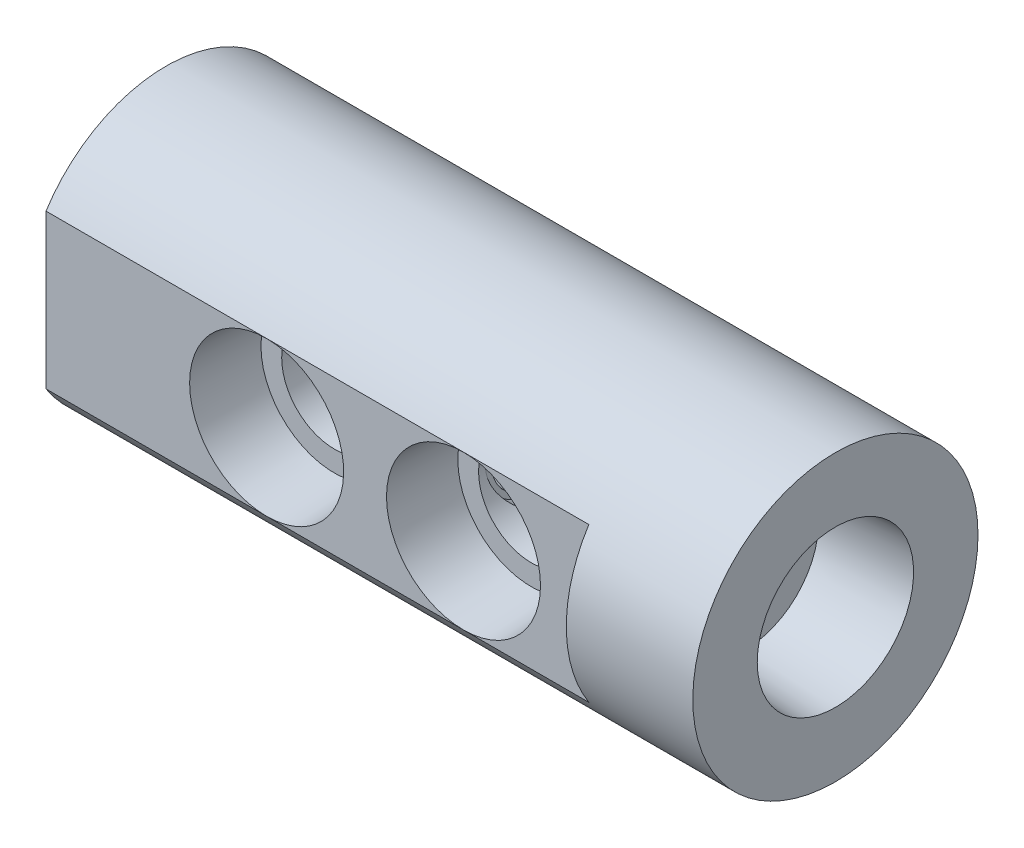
ISO-10303-21;
HEADER;
FILE_DESCRIPTION(('STEP AP214'),'2;1');
FILE_NAME('part.step','',(''),(''),'','','');
FILE_SCHEMA(('AUTOMOTIVE_DESIGN { 1 0 10303 214 1 1 1 1 }'));
ENDSEC;
DATA;
#1=APPLICATION_CONTEXT('core data for automotive mechanical design processes');
#2=APPLICATION_PROTOCOL_DEFINITION('international standard','automotive_design',2000,#1);
#3=PRODUCT_CONTEXT('',#1,'mechanical');
#4=PRODUCT('Part','Part','',(#3));
#5=PRODUCT_RELATED_PRODUCT_CATEGORY('part','',(#4));
#6=PRODUCT_DEFINITION_FORMATION('','',#4);
#7=PRODUCT_DEFINITION_CONTEXT('part definition',#1,'design');
#8=PRODUCT_DEFINITION('design','',#6,#7);
#9=PRODUCT_DEFINITION_SHAPE('','',#8);
#10=(LENGTH_UNIT() NAMED_UNIT(*) SI_UNIT(.MILLI.,.METRE.));
#11=(NAMED_UNIT(*) PLANE_ANGLE_UNIT() SI_UNIT($,.RADIAN.));
#12=(NAMED_UNIT(*) SI_UNIT($,.STERADIAN.) SOLID_ANGLE_UNIT());
#13=UNCERTAINTY_MEASURE_WITH_UNIT(LENGTH_MEASURE(1.E-05),#10,'distance_accuracy_value','');
#14=(GEOMETRIC_REPRESENTATION_CONTEXT(3) GLOBAL_UNCERTAINTY_ASSIGNED_CONTEXT((#13)) GLOBAL_UNIT_ASSIGNED_CONTEXT((#10,
#11,#12)) REPRESENTATION_CONTEXT('',''));
#15=CARTESIAN_POINT('',(0.,0.,0.));
#16=DIRECTION('',(0.,0.,1.));
#17=DIRECTION('',(1.,0.,0.));
#18=AXIS2_PLACEMENT_3D('',#15,#16,#17);
#19=CARTESIAN_POINT('',(19.3548,0.,25.019));
#20=DIRECTION('',(0.,0.,1.));
#21=DIRECTION('',(1.,0.,0.));
#22=AXIS2_PLACEMENT_3D('',#19,#20,#21);
#23=CONICAL_SURFACE('',#22,6.858,0.05235987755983);
#24=CARTESIAN_POINT('',(19.3548,0.,23.0388879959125));
#25=DIRECTION('',(0.,0.,-1.));
#26=DIRECTION('',(-1.,0.,0.));
#27=AXIS2_PLACEMENT_3D('',#24,#25,#26);
#28=CIRCLE('',#27,6.75422672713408);
#29=CARTESIAN_POINT('',(19.3548,6.75422672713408,23.0388879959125));
#30=VERTEX_POINT('',#29);
#31=CARTESIAN_POINT('',(19.3548,-6.75422672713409,23.0388879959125));
#32=VERTEX_POINT('',#31);
#33=EDGE_CURVE('E41',#30,#32,#28,.T.);
#34=ORIENTED_EDGE('',*,*,#33,.F.);
#35=EDGE_CURVE('E267',#32,#30,#28,.T.);
#36=ORIENTED_EDGE('',*,*,#35,.F.);
#37=EDGE_LOOP('',(#34,#36));
#38=FACE_BOUND('',#37,.T.);
#39=CARTESIAN_POINT('',(24.9426,3.28522577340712,17.8443354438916));
#40=CARTESIAN_POINT('',(25.0098535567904,3.17769136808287,17.910561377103));
#41=CARTESIAN_POINT('',(25.0745259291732,3.06693080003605,17.9742778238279));
#42=CARTESIAN_POINT('',(25.1980747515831,2.83907364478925,18.0960488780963));
#43=CARTESIAN_POINT('',(25.2569454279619,2.72197092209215,18.154097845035));
#44=CARTESIAN_POINT('',(25.3685134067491,2.48091294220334,18.2641438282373));
#45=CARTESIAN_POINT('',(25.4211643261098,2.35691524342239,18.316095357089));
#46=CARTESIAN_POINT('',(25.5190393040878,2.10329975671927,18.412695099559));
#47=CARTESIAN_POINT('',(25.5642654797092,1.97368358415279,18.4573453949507));
#48=CARTESIAN_POINT('',(25.6468239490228,1.70857831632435,18.5388687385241));
#49=CARTESIAN_POINT('',(25.6841042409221,1.57305712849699,18.5756905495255));
#50=CARTESIAN_POINT('',(25.7496893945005,1.29779284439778,18.6404784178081));
#51=CARTESIAN_POINT('',(25.7779954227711,1.15805029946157,18.6684456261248));
#52=CARTESIAN_POINT('',(25.824958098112,0.875885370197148,18.7148504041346));
#53=CARTESIAN_POINT('',(25.8436471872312,0.733473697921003,18.7333200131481));
#54=CARTESIAN_POINT('',(25.8710917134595,0.446775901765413,18.7604433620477));
#55=CARTESIAN_POINT('',(25.8798484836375,0.302490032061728,18.7690984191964));
#56=CARTESIAN_POINT('',(25.8868527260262,0.0280365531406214,18.7760212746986));
#57=CARTESIAN_POINT('',(25.8860731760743,-0.102083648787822,18.7752507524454));
#58=CARTESIAN_POINT('',(25.8763434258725,-0.361714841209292,18.7656341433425));
#59=CARTESIAN_POINT('',(25.8673934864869,-0.491225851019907,18.7567883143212));
#60=CARTESIAN_POINT('',(25.8414797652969,-0.748769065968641,18.7311780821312));
#61=CARTESIAN_POINT('',(25.82450891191,-0.876799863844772,18.7144066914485));
#62=CARTESIAN_POINT('',(25.782876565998,-1.13033251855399,18.6732686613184));
#63=CARTESIAN_POINT('',(25.7582150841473,-1.25583437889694,18.648902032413));
#64=CARTESIAN_POINT('',(25.6750789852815,-1.6195493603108,18.5667728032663));
#65=CARTESIAN_POINT('',(25.6065577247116,-1.85334194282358,18.4990957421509));
#66=CARTESIAN_POINT('',(25.4459752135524,-2.30412363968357,18.3405721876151));
#67=CARTESIAN_POINT('',(25.3539148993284,-2.52111342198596,18.2497266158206));
#68=CARTESIAN_POINT('',(25.2045099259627,-2.82565876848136,18.1023970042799));
#69=CARTESIAN_POINT('',(25.1547264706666,-2.92070066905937,18.0533191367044));
#70=CARTESIAN_POINT('',(25.0514084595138,-3.10627395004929,17.9515029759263));
#71=CARTESIAN_POINT('',(24.9978847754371,-3.19681719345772,17.8987752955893));
#72=CARTESIAN_POINT('',(24.9426,-3.28522577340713,17.8443354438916));
#73=B_SPLINE_CURVE_WITH_KNOTS('',3,(#39,#40,#41,#42,#43,#44,#45,#46,#47,#48,#49,#50,#51,#52,#53,
#54,#55,#56,#57,#58,#59,#60,#61,#62,#63,#64,#65,#66,#67,#68,#69,#70,#71,#72),.UNSPECIFIED.,.F.,
.F.,(4,2,2,2,2,2,2,2,2,2,2,2,2,2,2,2,4),(0.,0.429240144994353,0.858903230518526,
1.29159143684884,1.72415605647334,2.1594701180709,2.59472756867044,3.02850692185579,
3.46222804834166,3.85210033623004,4.24196017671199,4.63216437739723,5.02236803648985,
5.77769566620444,6.53299325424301,6.88677543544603,7.23956892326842),.UNSPECIFIED.);
#74=CARTESIAN_POINT('',(24.9428,3.28490593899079,17.8445323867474));
#75=VERTEX_POINT('',#74);
#76=CARTESIAN_POINT('',(24.9428,-3.28490593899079,17.8445323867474));
#77=VERTEX_POINT('',#76);
#78=EDGE_CURVE('E223',#75,#77,#73,.T.);
#79=ORIENTED_EDGE('',*,*,#78,.T.);
#80=CARTESIAN_POINT('',(24.9428,-4.43908443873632,30.3352120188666));
#81=CARTESIAN_POINT('',(24.9428,-4.35269416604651,29.3103111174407));
#82=CARTESIAN_POINT('',(24.9428,-4.26484071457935,28.2855307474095));
#83=CARTESIAN_POINT('',(24.9428,-4.08543482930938,26.2363152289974));
#84=CARTESIAN_POINT('',(24.9428,-3.99388247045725,25.2118800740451));
#85=CARTESIAN_POINT('',(24.9428,-3.80633357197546,23.163754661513));
#86=CARTESIAN_POINT('',(24.9428,-3.71033850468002,22.1400642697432));
#87=CARTESIAN_POINT('',(24.9428,-3.51271491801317,20.0931971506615));
#88=CARTESIAN_POINT('',(24.9428,-3.41108624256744,19.0700204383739));
#89=CARTESIAN_POINT('',(24.9428,-3.20050659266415,17.0240114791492));
#90=CARTESIAN_POINT('',(24.9428,-3.09155279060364,16.0011795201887));
#91=CARTESIAN_POINT('',(24.9428,-2.920654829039,14.4677984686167));
#92=CARTESIAN_POINT('',(24.9428,-2.86244637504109,13.9568330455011));
#93=CARTESIAN_POINT('',(24.9428,-2.7430308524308,12.9352460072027));
#94=CARTESIAN_POINT('',(24.9428,-2.68182375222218,12.4246243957));
#95=CARTESIAN_POINT('',(24.9428,-2.55573467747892,11.4036472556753));
#96=CARTESIAN_POINT('',(24.9428,-2.49085139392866,10.8932918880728));
#97=CARTESIAN_POINT('',(24.9428,-2.35649958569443,9.87319774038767));
#98=CARTESIAN_POINT('',(24.9428,-2.28703119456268,9.36345894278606));
#99=CARTESIAN_POINT('',(24.9428,-2.14212843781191,8.34470464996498));
#100=CARTESIAN_POINT('',(24.9428,-2.06669275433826,7.83568933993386));
#101=CARTESIAN_POINT('',(24.9428,-1.94740940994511,7.07309797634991));
#102=CARTESIAN_POINT('',(24.9428,-1.90662451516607,6.8190437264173));
#103=CARTESIAN_POINT('',(24.9428,-1.82255100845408,6.31134296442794));
#104=CARTESIAN_POINT('',(24.9428,-1.77926232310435,6.0576964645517));
#105=CARTESIAN_POINT('',(24.9428,-1.73449224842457,5.8043057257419));
#106=B_SPLINE_CURVE_WITH_KNOTS('',3,(#80,#81,#82,#83,#84,#85,#86,#87,#88,#89,#90,#91,#92,#93,
#94,#95,#96,#97,#98,#99,#100,#101,#102,#103,#104,#105),.UNSPECIFIED.,.F.,.F.,(4,2,2,2,2,2,2,2,2,
2,2,2,4),(0.,3.08560936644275,6.17115624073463,9.25568777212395,12.3403048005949,
15.4261194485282,16.968923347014,18.5117435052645,20.055116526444,21.5984446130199,
23.1421144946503,23.9140249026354,24.6859579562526),.UNSPECIFIED.);
#107=CARTESIAN_POINT('',(24.9428,-3.20661293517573,17.0942));
#108=VERTEX_POINT('',#107);
#109=EDGE_CURVE('E217',#77,#108,#106,.T.);
#110=ORIENTED_EDGE('',*,*,#109,.T.);
#111=CARTESIAN_POINT('',(19.3548,0.,17.0942));
#112=DIRECTION('',(0.,0.,-1.));
#113=DIRECTION('',(-1.,0.,0.));
#114=AXIS2_PLACEMENT_3D('',#111,#112,#113);
#115=CIRCLE('',#114,6.44267883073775);
#116=CARTESIAN_POINT('',(24.9428,3.20661293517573,17.0942));
#117=VERTEX_POINT('',#116);
#118=EDGE_CURVE('E326',#108,#117,#115,.T.);
#119=ORIENTED_EDGE('',*,*,#118,.T.);
#120=CARTESIAN_POINT('',(24.9428,1.73449224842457,5.8043057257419));
#121=CARTESIAN_POINT('',(24.9428,1.77926232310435,6.0576964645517));
#122=CARTESIAN_POINT('',(24.9428,1.82255100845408,6.31134296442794));
#123=CARTESIAN_POINT('',(24.9428,1.90662451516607,6.8190437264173));
#124=CARTESIAN_POINT('',(24.9428,1.94740940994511,7.07309797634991));
#125=CARTESIAN_POINT('',(24.9428,2.06669275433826,7.83568933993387));
#126=CARTESIAN_POINT('',(24.9428,2.14212843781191,8.34470464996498));
#127=CARTESIAN_POINT('',(24.9428,2.28703119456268,9.36345894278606));
#128=CARTESIAN_POINT('',(24.9428,2.35649958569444,9.87319774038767));
#129=CARTESIAN_POINT('',(24.9428,2.49085139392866,10.8932918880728));
#130=CARTESIAN_POINT('',(24.9428,2.55573467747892,11.4036472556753));
#131=CARTESIAN_POINT('',(24.9428,2.68182375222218,12.4246243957));
#132=CARTESIAN_POINT('',(24.9428,2.7430308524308,12.9352460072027));
#133=CARTESIAN_POINT('',(24.9428,2.86244637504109,13.9568330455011));
#134=CARTESIAN_POINT('',(24.9428,2.920654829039,14.4677984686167));
#135=CARTESIAN_POINT('',(24.9428,3.09155279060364,16.0011795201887));
#136=CARTESIAN_POINT('',(24.9428,3.20050659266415,17.0240114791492));
#137=CARTESIAN_POINT('',(24.9428,3.41108624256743,19.0700204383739));
#138=CARTESIAN_POINT('',(24.9428,3.51271491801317,20.0931971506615));
#139=CARTESIAN_POINT('',(24.9428,3.71033850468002,22.1400642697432));
#140=CARTESIAN_POINT('',(24.9428,3.80633357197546,23.163754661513));
#141=CARTESIAN_POINT('',(24.9428,3.99388247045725,25.2118800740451));
#142=CARTESIAN_POINT('',(24.9428,4.08543482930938,26.2363152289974));
#143=CARTESIAN_POINT('',(24.9428,4.26484071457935,28.2855307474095));
#144=CARTESIAN_POINT('',(24.9428,4.35269416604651,29.3103111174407));
#145=CARTESIAN_POINT('',(24.9428,4.43908443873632,30.3352120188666));
#146=B_SPLINE_CURVE_WITH_KNOTS('',3,(#120,#121,#122,#123,#124,#125,#126,#127,#128,#129,#130,
#131,#132,#133,#134,#135,#136,#137,#138,#139,#140,#141,#142,#143,#144,#145),.UNSPECIFIED.,.F.,
.F.,(4,2,2,2,2,2,2,2,2,2,2,2,4),(0.,0.771933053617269,1.54384346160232,3.08751334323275,
4.63084142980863,6.17421445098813,7.71703460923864,9.25983850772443,12.3456531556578,
15.4302701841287,18.514801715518,21.6003485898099,24.6859579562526),.UNSPECIFIED.);
#147=EDGE_CURVE('E33',#117,#75,#146,.T.);
#148=ORIENTED_EDGE('',*,*,#147,.T.);
#149=EDGE_LOOP('',(#79,#110,#119,#148));
#150=FACE_BOUND('',#149,.T.);
#151=ADVANCED_FACE('F16',(#38,#150),#23,.F.);
#152=CARTESIAN_POINT('',(25.7974788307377,0.,17.0942));
#153=DIRECTION('',(0.,0.,1.));
#154=DIRECTION('',(1.,0.,0.));
#155=AXIS2_PLACEMENT_3D('',#152,#153,#154);
#156=PLANE('',#155);
#157=CARTESIAN_POINT('',(19.3548,0.,17.0942));
#158=DIRECTION('',(0.,0.,-1.));
#159=DIRECTION('',(-1.,0.,0.));
#160=AXIS2_PLACEMENT_3D('',#157,#158,#159);
#161=CIRCLE('',#160,4.6228);
#162=CARTESIAN_POINT('',(14.732,0.,17.0942));
#163=VERTEX_POINT('',#162);
#164=EDGE_CURVE('E346',#163,#163,#161,.T.);
#165=ORIENTED_EDGE('',*,*,#164,.T.);
#166=EDGE_LOOP('',(#165));
#167=FACE_BOUND('',#166,.T.);
#168=ORIENTED_EDGE('',*,*,#118,.F.);
#169=DIRECTION('',(0.,1.,0.));
#170=VECTOR('',#169,1.);
#171=CARTESIAN_POINT('',(24.9428,0.,17.0942));
#172=LINE('',#171,#170);
#173=EDGE_CURVE('E820',#108,#117,#172,.T.);
#174=ORIENTED_EDGE('',*,*,#173,.T.);
#175=EDGE_LOOP('',(#168,#174));
#176=FACE_BOUND('',#175,.T.);
#177=ADVANCED_FACE('F195',(#167,#176),#156,.T.);
#178=CARTESIAN_POINT('',(36.6268,0.,25.019));
#179=DIRECTION('',(0.,0.,1.));
#180=DIRECTION('',(1.,0.,0.));
#181=AXIS2_PLACEMENT_3D('',#178,#179,#180);
#182=CONICAL_SURFACE('',#181,6.858,0.0523598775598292);
#183=CARTESIAN_POINT('',(36.6268,0.,23.0388879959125));
#184=DIRECTION('',(0.,0.,-1.));
#185=DIRECTION('',(-1.,0.,0.));
#186=AXIS2_PLACEMENT_3D('',#183,#184,#185);
#187=CIRCLE('',#186,6.75422672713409);
#188=CARTESIAN_POINT('',(36.6268,6.75422672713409,23.0388879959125));
#189=VERTEX_POINT('',#188);
#190=CARTESIAN_POINT('',(36.6268,-6.75422672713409,23.0388879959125));
#191=VERTEX_POINT('',#190);
#192=EDGE_CURVE('E25',#189,#191,#187,.T.);
#193=ORIENTED_EDGE('',*,*,#192,.F.);
#194=EDGE_CURVE('E184',#191,#189,#187,.T.);
#195=ORIENTED_EDGE('',*,*,#194,.F.);
#196=EDGE_LOOP('',(#193,#195));
#197=FACE_BOUND('',#196,.T.);
#198=CARTESIAN_POINT('',(36.6268,0.,17.0942));
#199=DIRECTION('',(0.,0.,-1.));
#200=DIRECTION('',(-1.,0.,0.));
#201=AXIS2_PLACEMENT_3D('',#198,#199,#200);
#202=CIRCLE('',#201,6.44267883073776);
#203=CARTESIAN_POINT('',(30.1841211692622,0.,17.0942));
#204=VERTEX_POINT('',#203);
#205=EDGE_CURVE('E352',#204,#204,#202,.T.);
#206=ORIENTED_EDGE('',*,*,#205,.T.);
#207=EDGE_LOOP('',(#206));
#208=FACE_BOUND('',#207,.T.);
#209=ADVANCED_FACE('F198',(#197,#208),#182,.F.);
#210=CARTESIAN_POINT('',(43.0694788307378,0.,17.0942));
#211=DIRECTION('',(0.,0.,1.));
#212=DIRECTION('',(1.,0.,0.));
#213=AXIS2_PLACEMENT_3D('',#210,#211,#212);
#214=PLANE('',#213);
#215=ORIENTED_EDGE('',*,*,#205,.F.);
#216=EDGE_LOOP('',(#215));
#217=FACE_BOUND('',#216,.T.);
#218=CARTESIAN_POINT('',(36.6268,0.,17.0942));
#219=DIRECTION('',(0.,0.,-1.));
#220=DIRECTION('',(-1.,0.,0.));
#221=AXIS2_PLACEMENT_3D('',#218,#219,#220);
#222=CIRCLE('',#221,4.6228);
#223=CARTESIAN_POINT('',(32.004,0.,17.0942));
#224=VERTEX_POINT('',#223);
#225=EDGE_CURVE('E355',#224,#224,#222,.T.);
#226=ORIENTED_EDGE('',*,*,#225,.T.);
#227=EDGE_LOOP('',(#226));
#228=FACE_BOUND('',#227,.T.);
#229=ADVANCED_FACE('F400',(#217,#228),#214,.T.);
#230=CARTESIAN_POINT('',(24.9428,0.,8.96242116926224));
#231=DIRECTION('',(1.,0.,0.));
#232=DIRECTION('',(0.,0.,-1.));
#233=AXIS2_PLACEMENT_3D('',#230,#231,#232);
#234=PLANE('',#233);
#235=CARTESIAN_POINT('',(24.9428,0.,12.5095));
#236=DIRECTION('',(-1.,0.,0.));
#237=DIRECTION('',(0.,0.,1.));
#238=AXIS2_PLACEMENT_3D('',#235,#236,#237);
#239=CIRCLE('',#238,2.921);
#240=CARTESIAN_POINT('',(24.9428,0.,15.4305));
#241=VERTEX_POINT('',#240);
#242=EDGE_CURVE('E20',#241,#241,#239,.T.);
#243=ORIENTED_EDGE('',*,*,#242,.T.);
#244=EDGE_LOOP('',(#243));
#245=FACE_BOUND('',#244,.T.);
#246=CARTESIAN_POINT('',(24.9428,0.,12.5095));
#247=DIRECTION('',(-1.,0.,0.));
#248=DIRECTION('',(0.,0.,1.));
#249=AXIS2_PLACEMENT_3D('',#246,#247,#248);
#250=CIRCLE('',#249,3.4544);
#251=CARTESIAN_POINT('',(24.9428,0.,15.9639));
#252=VERTEX_POINT('',#251);
#253=EDGE_CURVE('E818',#252,#252,#250,.T.);
#254=ORIENTED_EDGE('',*,*,#253,.F.);
#255=EDGE_LOOP('',(#254));
#256=FACE_BOUND('',#255,.T.);
#257=ADVANCED_FACE('F18',(#245,#256),#234,.T.);
#258=CARTESIAN_POINT('',(19.3548,0.,17.0942));
#259=DIRECTION('',(0.,0.,-1.));
#260=DIRECTION('',(-1.,0.,0.));
#261=AXIS2_PLACEMENT_3D('',#258,#259,#260);
#262=CYLINDRICAL_SURFACE('',#261,4.6228);
#263=ORIENTED_EDGE('',*,*,#164,.F.);
#264=EDGE_LOOP('',(#263));
#265=FACE_BOUND('',#264,.T.);
#266=CARTESIAN_POINT('',(19.3548,0.,5.46297482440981));
#267=DIRECTION('',(0.,0.,-1.));
#268=DIRECTION('',(-1.,0.,0.));
#269=AXIS2_PLACEMENT_3D('',#266,#267,#268);
#270=CIRCLE('',#269,4.6228);
#271=CARTESIAN_POINT('',(14.732,0.,5.46297482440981));
#272=VERTEX_POINT('',#271);
#273=EDGE_CURVE('E349',#272,#272,#270,.T.);
#274=ORIENTED_EDGE('',*,*,#273,.T.);
#275=EDGE_LOOP('',(#274));
#276=FACE_BOUND('',#275,.T.);
#277=CARTESIAN_POINT('',(23.9776,0.,15.4305));
#278=CARTESIAN_POINT('',(23.9775995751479,-0.074099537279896,15.4304994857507));
#279=CARTESIAN_POINT('',(23.975812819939,-0.14820112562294,15.4276747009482));
#280=CARTESIAN_POINT('',(23.9687190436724,-0.295817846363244,15.4164271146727));
#281=CARTESIAN_POINT('',(23.9634105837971,-0.369332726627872,15.4080020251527));
#282=CARTESIAN_POINT('',(23.94234876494,-0.588303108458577,15.3744428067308));
#283=CARTESIAN_POINT('',(23.921459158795,-0.732103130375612,15.3410248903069));
#284=CARTESIAN_POINT('',(23.8680853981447,-1.0102303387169,15.2541062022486));
#285=CARTESIAN_POINT('',(23.8356585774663,-1.14460050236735,15.2007046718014));
#286=CARTESIAN_POINT('',(23.7619007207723,-1.40202449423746,15.0760196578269));
#287=CARTESIAN_POINT('',(23.7205703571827,-1.52507917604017,15.0047375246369));
#288=CARTESIAN_POINT('',(23.6284538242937,-1.76757495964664,14.8399774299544));
#289=CARTESIAN_POINT('',(23.5771736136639,-1.8859220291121,14.745172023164));
#290=CARTESIAN_POINT('',(23.4717854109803,-2.10609632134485,14.5391243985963));
#291=CARTESIAN_POINT('',(23.4176736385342,-2.20790067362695,14.4278598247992));
#292=CARTESIAN_POINT('',(23.3036991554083,-2.40651478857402,14.1739573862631));
#293=CARTESIAN_POINT('',(23.2440829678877,-2.50066187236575,14.029108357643));
#294=CARTESIAN_POINT('',(23.1347729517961,-2.66302216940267,13.7221675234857));
#295=CARTESIAN_POINT('',(23.0850623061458,-2.73127951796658,13.5601056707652));
#296=CARTESIAN_POINT('',(23.0149854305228,-2.8241413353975,13.2667817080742));
#297=CARTESIAN_POINT('',(22.99033637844,-2.85551420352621,13.138692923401));
#298=CARTESIAN_POINT('',(22.9543827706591,-2.90071461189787,12.877700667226));
#299=CARTESIAN_POINT('',(22.9430587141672,-2.91456779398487,12.7448045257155));
#300=CARTESIAN_POINT('',(22.9354676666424,-2.92389210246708,12.4775428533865));
#301=CARTESIAN_POINT('',(22.9392432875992,-2.91931120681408,12.3431742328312));
#302=CARTESIAN_POINT('',(22.9613350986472,-2.89196655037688,12.0774823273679));
#303=CARTESIAN_POINT('',(22.979663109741,-2.86918800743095,11.9461616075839));
#304=CARTESIAN_POINT('',(23.0275530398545,-2.80759986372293,11.6933262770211));
#305=CARTESIAN_POINT('',(23.0568113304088,-2.76922127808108,11.5716456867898));
#306=CARTESIAN_POINT('',(23.1233334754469,-2.67798714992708,11.3362208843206));
#307=CARTESIAN_POINT('',(23.1606001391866,-2.62512652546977,11.2224794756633));
#308=CARTESIAN_POINT('',(23.2474801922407,-2.49490266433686,10.9831905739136));
#309=CARTESIAN_POINT('',(23.2980943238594,-2.41479266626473,10.8595026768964));
#310=CARTESIAN_POINT('',(23.4013804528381,-2.23741331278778,10.6259518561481));
#311=CARTESIAN_POINT('',(23.4540545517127,-2.14012605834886,10.5161035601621));
#312=CARTESIAN_POINT('',(23.5661844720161,-1.91139316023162,10.2940011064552));
#313=CARTESIAN_POINT('',(23.6252415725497,-1.77695003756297,10.1846043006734));
#314=CARTESIAN_POINT('',(23.7342567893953,-1.48807336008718,9.98995700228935));
#315=CARTESIAN_POINT('',(23.7842180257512,-1.33364669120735,9.90469822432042));
#316=CARTESIAN_POINT('',(23.8469753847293,-1.0940982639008,9.79982978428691));
#317=CARTESIAN_POINT('',(23.8655164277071,-1.01513219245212,9.76924785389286));
#318=CARTESIAN_POINT('',(23.8987497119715,-0.854129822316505,9.71487874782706));
#319=CARTESIAN_POINT('',(23.9134441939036,-0.772095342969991,9.69108761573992));
#320=CARTESIAN_POINT('',(23.9385182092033,-0.60570328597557,9.65070929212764));
#321=CARTESIAN_POINT('',(23.9489018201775,-0.521347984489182,9.6341152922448));
#322=CARTESIAN_POINT('',(23.9650422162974,-0.351102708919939,9.60839842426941));
#323=CARTESIAN_POINT('',(23.970799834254,-0.265213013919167,9.59927421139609));
#324=CARTESIAN_POINT('',(23.979786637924,-0.0327789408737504,9.58502706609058));
#325=CARTESIAN_POINT('',(23.978484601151,0.114473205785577,9.58708098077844));
#326=CARTESIAN_POINT('',(23.9620470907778,0.406122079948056,9.61316102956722));
#327=CARTESIAN_POINT('',(23.9469127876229,0.550519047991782,9.63718530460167));
#328=CARTESIAN_POINT('',(23.9052158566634,0.826189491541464,9.70434372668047));
#329=CARTESIAN_POINT('',(23.8791805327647,0.957760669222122,9.74659858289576));
#330=CARTESIAN_POINT('',(23.8178686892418,1.21177288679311,9.84818828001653));
#331=CARTESIAN_POINT('',(23.7825906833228,1.33421245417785,9.90752586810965));
#332=CARTESIAN_POINT('',(23.7014041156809,1.57976519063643,10.0480879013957));
#333=CARTESIAN_POINT('',(23.6547863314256,1.70172830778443,10.1309047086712));
#334=CARTESIAN_POINT('',(23.5568987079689,1.93085609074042,10.31280353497));
#335=CARTESIAN_POINT('',(23.5056238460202,2.03800445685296,10.4119032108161));
#336=CARTESIAN_POINT('',(23.3945531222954,2.251032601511,10.6405367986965));
#337=CARTESIAN_POINT('',(23.3346250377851,2.35434921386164,10.7724051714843));
#338=CARTESIAN_POINT('',(23.220214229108,2.53782210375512,11.0535361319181));
#339=CARTESIAN_POINT('',(23.1657283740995,2.61799174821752,11.2027886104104));
#340=CARTESIAN_POINT('',(23.0797591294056,2.73848050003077,11.4841706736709));
#341=CARTESIAN_POINT('',(23.0458493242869,2.78360760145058,11.613488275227));
#342=CARTESIAN_POINT('',(22.9904538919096,2.85558908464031,11.8795939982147));
#343=CARTESIAN_POINT('',(22.9689484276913,2.88247265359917,12.0163698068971));
#344=CARTESIAN_POINT('',(22.9415599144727,2.91649612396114,12.2948692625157));
#345=CARTESIAN_POINT('',(22.9357758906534,2.92351088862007,12.4366186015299));
#346=CARTESIAN_POINT('',(22.9411744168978,2.91688369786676,12.7193305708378));
#347=CARTESIAN_POINT('',(22.9523610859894,2.90323672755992,12.8602930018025));
#348=CARTESIAN_POINT('',(22.9880223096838,2.85843900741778,13.1242160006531));
#349=CARTESIAN_POINT('',(23.0112071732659,2.82897827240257,13.2476534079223));
#350=CARTESIAN_POINT('',(23.0671118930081,2.75520463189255,13.4876989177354));
#351=CARTESIAN_POINT('',(23.099835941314,2.71088519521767,13.6043039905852));
#352=CARTESIAN_POINT('',(23.1767353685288,2.60156599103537,13.8451552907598));
#353=CARTESIAN_POINT('',(23.2218744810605,2.53453257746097,13.968164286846));
#354=CARTESIAN_POINT('',(23.3161548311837,2.38449312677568,14.202367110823));
#355=CARTESIAN_POINT('',(23.365299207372,2.30147449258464,14.3135515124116));
#356=CARTESIAN_POINT('',(23.4740355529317,2.10181834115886,14.5448241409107));
#357=CARTESIAN_POINT('',(23.53367912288,1.98177940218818,14.6619715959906));
#358=CARTESIAN_POINT('',(23.6474127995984,1.72158986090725,14.8752160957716));
#359=CARTESIAN_POINT('',(23.701498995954,1.58142526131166,14.9712983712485));
#360=CARTESIAN_POINT('',(23.7745749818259,1.35727270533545,15.097462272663));
#361=CARTESIAN_POINT('',(23.7977160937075,1.27968175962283,15.1367206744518));
#362=CARTESIAN_POINT('',(23.8404990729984,1.12051627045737,15.208442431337));
#363=CARTESIAN_POINT('',(23.8601429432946,1.03894404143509,15.2409096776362));
#364=CARTESIAN_POINT('',(23.8952851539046,0.87262950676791,15.298493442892));
#365=CARTESIAN_POINT('',(23.9107943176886,0.787896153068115,15.3236291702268));
#366=CARTESIAN_POINT('',(23.9372175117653,0.615866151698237,15.366209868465));
#367=CARTESIAN_POINT('',(23.9481348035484,0.528571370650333,15.3836602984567));
#368=CARTESIAN_POINT('',(23.9635230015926,0.367805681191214,15.4081827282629));
#369=CARTESIAN_POINT('',(23.9687900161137,0.294603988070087,15.4165403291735));
#370=CARTESIAN_POINT('',(23.9758288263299,0.147602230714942,15.4276993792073));
#371=CARTESIAN_POINT('',(23.9776004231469,0.0738021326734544,15.4305005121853));
#372=CARTESIAN_POINT('',(23.9776,0.,15.4305));
#373=B_SPLINE_CURVE_WITH_KNOTS('',3,(#277,#278,#279,#280,#281,#282,#283,#284,#285,#286,#287,
#288,#289,#290,#291,#292,#293,#294,#295,#296,#297,#298,#299,#300,#301,#302,#303,#304,#305,#306,
#307,#308,#309,#310,#311,#312,#313,#314,#315,#316,#317,#318,#319,#320,#321,#322,#323,#324,#325,
#326,#327,#328,#329,#330,#331,#332,#333,#334,#335,#336,#337,#338,#339,#340,#341,#342,#343,#344,
#345,#346,#347,#348,#349,#350,#351,#352,#353,#354,#355,#356,#357,#358,#359,#360,#361,#362,#363,
#364,#365,#366,#367,#368,#369,#370,#371,#372),.UNSPECIFIED.,.T.,.F.,(4,2,2,2,2,2,2,2,2,2,2,2,2,
2,2,2,2,2,2,2,2,2,2,2,2,2,2,2,2,2,2,2,2,2,2,2,2,2,2,2,2,2,2,2,2,2,2,4),(0.,0.222219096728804,
0.444529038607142,0.889389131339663,1.33206869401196,1.77471483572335,2.2531018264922,
2.73214466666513,3.27779559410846,3.82251210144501,4.22333006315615,4.62356070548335,
5.0249216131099,5.42660888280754,5.8178800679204,6.20928873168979,6.67502375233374,
7.14124697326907,7.68794215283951,8.2344494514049,8.49417636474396,8.75375164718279,
9.01308083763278,9.27236333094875,9.71167201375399,10.1509435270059,10.5710538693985,
10.9912318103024,11.4533041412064,11.9158808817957,12.4473166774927,12.9784449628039,
13.4000935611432,13.8210659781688,14.2446839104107,14.6684046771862,15.0539028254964,
15.439570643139,15.8795627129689,16.3199029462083,16.8516271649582,17.3837230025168,
17.6533320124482,17.9227861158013,18.191527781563,18.4600782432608,18.6813928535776,
18.9027200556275),.UNSPECIFIED.);
#374=CARTESIAN_POINT('',(23.9776,0.,15.4305));
#375=VERTEX_POINT('',#374);
#376=EDGE_CURVE('E177',#375,#375,#373,.T.);
#377=ORIENTED_EDGE('',*,*,#376,.T.);
#378=EDGE_LOOP('',(#377));
#379=FACE_BOUND('',#378,.T.);
#380=ADVANCED_FACE('F187',(#265,#276,#379),#262,.F.);
#381=CARTESIAN_POINT('',(36.6268,0.,17.0942));
#382=DIRECTION('',(0.,0.,-1.));
#383=DIRECTION('',(-1.,0.,0.));
#384=AXIS2_PLACEMENT_3D('',#381,#382,#383);
#385=CYLINDRICAL_SURFACE('',#384,4.6228);
#386=CARTESIAN_POINT('',(32.004,0.,16.4719));
#387=CARTESIAN_POINT('',(32.0039958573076,0.093327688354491,16.4719042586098));
#388=CARTESIAN_POINT('',(32.0068297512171,0.186622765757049,16.468599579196));
#389=CARTESIAN_POINT('',(32.0180885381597,0.372441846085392,16.4554558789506));
#390=CARTESIAN_POINT('',(32.026514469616,0.464965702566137,16.4456156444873));
#391=CARTESIAN_POINT('',(32.0487788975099,0.648500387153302,16.4195712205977));
#392=CARTESIAN_POINT('',(32.0626203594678,0.739510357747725,16.4033635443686));
#393=CARTESIAN_POINT('',(32.0954081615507,0.919314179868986,16.364878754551));
#394=CARTESIAN_POINT('',(32.114356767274,1.00810702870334,16.3425989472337));
#395=CARTESIAN_POINT('',(32.1780349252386,1.26909209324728,16.267499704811));
#396=CARTESIAN_POINT('',(32.2297700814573,1.43725022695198,16.2062200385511));
#397=CARTESIAN_POINT('',(32.3483535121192,1.75918975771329,16.0643471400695));
#398=CARTESIAN_POINT('',(32.4152067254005,1.91296643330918,15.9837475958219));
#399=CARTESIAN_POINT('',(32.5880215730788,2.26031069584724,15.7724916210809));
#400=CARTESIAN_POINT('',(32.6991985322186,2.44684451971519,15.6344447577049));
#401=CARTESIAN_POINT('',(32.8754197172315,2.70338765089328,15.4087027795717));
#402=CARTESIAN_POINT('',(32.9358541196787,2.78515259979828,15.3301843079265));
#403=CARTESIAN_POINT('',(33.0587748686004,2.94096818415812,15.1673187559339));
#404=CARTESIAN_POINT('',(33.1212604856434,3.01502152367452,15.0829737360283));
#405=CARTESIAN_POINT('',(33.248381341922,3.15686985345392,14.9069635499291));
#406=CARTESIAN_POINT('',(33.3130344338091,3.22450645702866,14.8151841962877));
#407=CARTESIAN_POINT('',(33.4418577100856,3.35180828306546,14.6258673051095));
#408=CARTESIAN_POINT('',(33.5060277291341,3.41147088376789,14.5283278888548));
#409=CARTESIAN_POINT('',(33.6319972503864,3.52256557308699,14.3275449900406));
#410=CARTESIAN_POINT('',(33.6938014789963,3.57401480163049,14.2243140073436));
#411=CARTESIAN_POINT('',(33.8128536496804,3.66848090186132,14.0116272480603));
#412=CARTESIAN_POINT('',(33.8701052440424,3.7115045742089,13.9021765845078));
#413=CARTESIAN_POINT('',(33.9799666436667,3.79069612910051,13.6701518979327));
#414=CARTESIAN_POINT('',(34.032136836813,3.82634502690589,13.5471861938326));
#415=CARTESIAN_POINT('',(34.1226872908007,3.88621640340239,13.2935853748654));
#416=CARTESIAN_POINT('',(34.1610957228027,3.91046225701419,13.162966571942));
#417=CARTESIAN_POINT('',(34.2040794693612,3.93712986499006,12.961525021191));
#418=CARTESIAN_POINT('',(34.2160043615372,3.94442053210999,12.8928836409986));
#419=CARTESIAN_POINT('',(34.2340939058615,3.95542063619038,12.7545784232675));
#420=CARTESIAN_POINT('',(34.2402618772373,3.95913213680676,12.684915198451));
#421=CARTESIAN_POINT('',(34.2464462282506,3.96285378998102,12.5452577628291));
#422=CARTESIAN_POINT('',(34.2464666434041,3.96286637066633,12.4752637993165));
#423=CARTESIAN_POINT('',(34.2403775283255,3.95920143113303,12.335657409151));
#424=CARTESIAN_POINT('',(34.2342680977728,3.95552397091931,12.2660449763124));
#425=CARTESIAN_POINT('',(34.2100471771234,3.94080234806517,12.0800874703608));
#426=CARTESIAN_POINT('',(34.1865600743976,3.92642414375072,11.9646793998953));
#427=CARTESIAN_POINT('',(34.1264931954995,3.88844100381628,11.7388974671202));
#428=CARTESIAN_POINT('',(34.0898903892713,3.86481983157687,11.6285328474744));
#429=CARTESIAN_POINT('',(34.011063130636,3.81185731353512,11.4229364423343));
#430=CARTESIAN_POINT('',(33.9696079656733,3.78319499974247,11.3272245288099));
#431=CARTESIAN_POINT('',(33.8813731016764,3.719659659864,11.1403784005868));
#432=CARTESIAN_POINT('',(33.8345892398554,3.68478176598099,11.049247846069));
#433=CARTESIAN_POINT('',(33.7374613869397,3.60912775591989,10.8711494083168));
#434=CARTESIAN_POINT('',(33.687109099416,3.56833764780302,10.7841920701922));
#435=CARTESIAN_POINT('',(33.5843723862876,3.4811571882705,10.6144381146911));
#436=CARTESIAN_POINT('',(33.5319884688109,3.43476823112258,10.5316404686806));
#437=CARTESIAN_POINT('',(33.4219993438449,3.33250886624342,10.3634688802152));
#438=CARTESIAN_POINT('',(33.3643144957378,3.27617506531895,10.2784281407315));
#439=CARTESIAN_POINT('',(33.2489654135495,3.15711868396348,10.1129173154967));
#440=CARTESIAN_POINT('',(33.1913011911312,3.09439415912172,10.0324486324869));
#441=CARTESIAN_POINT('',(33.0199596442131,2.89677332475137,9.79821993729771));
#442=CARTESIAN_POINT('',(32.9077144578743,2.75223321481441,9.65131363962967));
#443=CARTESIAN_POINT('',(32.6995580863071,2.44535088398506,9.3854052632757));
#444=CARTESIAN_POINT('',(32.6031087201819,2.28427348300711,9.26536980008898));
#445=CARTESIAN_POINT('',(32.4260346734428,1.93940182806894,9.04818299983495));
#446=CARTESIAN_POINT('',(32.3453948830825,1.7556295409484,8.95100979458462));
#447=CARTESIAN_POINT('',(32.2185403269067,1.40224347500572,8.7994496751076));
#448=CARTESIAN_POINT('',(32.1687605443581,1.23586512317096,8.7405365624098));
#449=CARTESIAN_POINT('',(32.0875661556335,0.892559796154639,8.64483635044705));
#450=CARTESIAN_POINT('',(32.0561380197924,0.715640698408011,8.60803295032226));
#451=CARTESIAN_POINT('',(32.0140740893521,0.35510981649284,8.55883683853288));
#452=CARTESIAN_POINT('',(32.0035337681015,0.171471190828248,8.54655621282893));
#453=CARTESIAN_POINT('',(32.0044979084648,-0.195673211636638,8.54768074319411));
#454=CARTESIAN_POINT('',(32.0160014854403,-0.379178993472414,8.56108486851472));
#455=CARTESIAN_POINT('',(32.0583780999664,-0.726803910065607,8.61065923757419));
#456=CARTESIAN_POINT('',(32.0877764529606,-0.891360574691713,8.64509681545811));
#457=CARTESIAN_POINT('',(32.1625155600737,-1.21139111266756,8.73316432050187));
#458=CARTESIAN_POINT('',(32.2078588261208,-1.36686355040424,8.7867972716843));
#459=CARTESIAN_POINT('',(32.3160087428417,-1.67830627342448,8.91581209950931));
#460=CARTESIAN_POINT('',(32.3799330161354,-1.83329539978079,8.99260450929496));
#461=CARTESIAN_POINT('',(32.5197139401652,-2.12809172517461,9.16273268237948));
#462=CARTESIAN_POINT('',(32.5955797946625,-2.2678870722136,9.25608121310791));
#463=CARTESIAN_POINT('',(32.7358870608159,-2.49891198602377,9.43190329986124));
#464=CARTESIAN_POINT('',(32.7985114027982,-2.59360032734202,9.51135379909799));
#465=CARTESIAN_POINT('',(32.9271298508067,-2.77398353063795,9.67742334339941));
#466=CARTESIAN_POINT('',(32.9931241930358,-2.85967776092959,9.76404289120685));
#467=CARTESIAN_POINT('',(33.1271931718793,-3.02227754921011,9.94411377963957));
#468=CARTESIAN_POINT('',(33.1952721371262,-3.09916299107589,10.0375799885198));
#469=CARTESIAN_POINT('',(33.331813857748,-3.24395364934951,10.2309120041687));
#470=CARTESIAN_POINT('',(33.4002764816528,-3.31186176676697,10.3307757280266));
#471=CARTESIAN_POINT('',(33.5202733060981,-3.42416389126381,10.5133971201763));
#472=CARTESIAN_POINT('',(33.572099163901,-3.47038424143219,10.5948456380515));
#473=CARTESIAN_POINT('',(33.6738447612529,-3.55735990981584,10.7617416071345));
#474=CARTESIAN_POINT('',(33.7237649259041,-3.59811645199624,10.8471881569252));
#475=CARTESIAN_POINT('',(33.8202741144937,-3.67388691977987,11.0221416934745));
#476=CARTESIAN_POINT('',(33.8668704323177,-3.70891365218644,11.1116390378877));
#477=CARTESIAN_POINT('',(33.9550910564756,-3.77295927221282,11.2950760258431));
#478=CARTESIAN_POINT('',(33.9967184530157,-3.80198190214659,11.3890128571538));
#479=CARTESIAN_POINT('',(34.0812645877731,-3.85923280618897,11.6029866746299));
#480=CARTESIAN_POINT('',(34.1224169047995,-3.88585316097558,11.724186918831));
#481=CARTESIAN_POINT('',(34.1888285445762,-3.92786878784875,11.9726161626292));
#482=CARTESIAN_POINT('',(34.2141286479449,-3.94329287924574,12.099828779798));
#483=CARTESIAN_POINT('',(34.2444288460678,-3.96168578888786,12.3590215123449));
#484=CARTESIAN_POINT('',(34.249222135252,-3.96452772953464,12.4910367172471));
#485=CARTESIAN_POINT('',(34.2368192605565,-3.9570569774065,12.7536862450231));
#486=CARTESIAN_POINT('',(34.2196021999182,-3.9467317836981,12.8843191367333));
#487=CARTESIAN_POINT('',(34.1617913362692,-3.91092306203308,13.1644076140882));
#488=CARTESIAN_POINT('',(34.1173688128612,-3.88292640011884,13.3127077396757));
#489=CARTESIAN_POINT('',(34.0114631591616,-3.81238851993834,13.5995921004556));
#490=CARTESIAN_POINT('',(33.9499193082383,-3.7697954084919,13.7381395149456));
#491=CARTESIAN_POINT('',(33.8279179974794,-3.67985627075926,13.9837646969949));
#492=CARTESIAN_POINT('',(33.7689134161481,-3.63441151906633,14.0922946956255));
#493=CARTESIAN_POINT('',(33.6469472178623,-3.53510160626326,14.3031733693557));
#494=CARTESIAN_POINT('',(33.5839831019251,-3.48123109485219,14.4055180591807));
#495=CARTESIAN_POINT('',(33.4562081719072,-3.36527687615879,14.6044446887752));
#496=CARTESIAN_POINT('',(33.3913949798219,-3.30318218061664,14.7010186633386));
#497=CARTESIAN_POINT('',(33.2616721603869,-3.17092666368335,14.8883609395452));
#498=CARTESIAN_POINT('',(33.1967625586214,-3.1007676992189,14.9791305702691));
#499=CARTESIAN_POINT('',(33.0650787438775,-2.94873250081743,15.1590523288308));
#500=CARTESIAN_POINT('',(32.9983677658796,-2.86645192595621,15.2479101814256));
#501=CARTESIAN_POINT('',(32.867771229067,-2.69291307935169,15.4187367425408));
#502=CARTESIAN_POINT('',(32.8038862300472,-2.60165304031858,15.5007040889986));
#503=CARTESIAN_POINT('',(32.6805004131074,-2.4103768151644,15.6568634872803));
#504=CARTESIAN_POINT('',(32.6209895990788,-2.31038181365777,15.7310734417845));
#505=CARTESIAN_POINT('',(32.5076519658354,-2.10166643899,15.8709566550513));
#506=CARTESIAN_POINT('',(32.4538222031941,-1.99295063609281,15.9366343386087));
#507=CARTESIAN_POINT('',(32.3340721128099,-1.72392328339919,16.0816288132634));
#508=CARTESIAN_POINT('',(32.2713733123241,-1.55975023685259,16.1565905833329));
#509=CARTESIAN_POINT('',(32.1636801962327,-1.2177229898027,16.284545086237));
#510=CARTESIAN_POINT('',(32.1186573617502,-1.03989138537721,16.3375732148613));
#511=CARTESIAN_POINT('',(32.0579391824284,-0.71824713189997,16.4088686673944));
#512=CARTESIAN_POINT('',(32.0378126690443,-0.576420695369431,16.4324071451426));
#513=CARTESIAN_POINT('',(32.0108458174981,-0.289703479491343,16.4639200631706));
#514=CARTESIAN_POINT('',(32.0040064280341,-0.144812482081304,16.4718933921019));
#515=CARTESIAN_POINT('',(32.004,0.,16.4719));
#516=B_SPLINE_CURVE_WITH_KNOTS('',3,(#386,#387,#388,#389,#390,#391,#392,#393,#394,#395,#396,
#397,#398,#399,#400,#401,#402,#403,#404,#405,#406,#407,#408,#409,#410,#411,#412,#413,#414,#415,
#416,#417,#418,#419,#420,#421,#422,#423,#424,#425,#426,#427,#428,#429,#430,#431,#432,#433,#434,
#435,#436,#437,#438,#439,#440,#441,#442,#443,#444,#445,#446,#447,#448,#449,#450,#451,#452,#453,
#454,#455,#456,#457,#458,#459,#460,#461,#462,#463,#464,#465,#466,#467,#468,#469,#470,#471,#472,
#473,#474,#475,#476,#477,#478,#479,#480,#481,#482,#483,#484,#485,#486,#487,#488,#489,#490,#491,
#492,#493,#494,#495,#496,#497,#498,#499,#500,#501,#502,#503,#504,#505,#506,#507,#508,#509,#510,
#511,#512,#513,#514,#515),.UNSPECIFIED.,.T.,.F.,(4,2,2,2,2,2,2,2,2,2,2,2,2,2,2,2,2,2,2,2,2,2,2,
2,2,2,2,2,2,2,2,2,2,2,2,2,2,2,2,2,2,2,2,2,2,2,2,2,2,2,2,2,2,2,2,2,2,2,2,2,2,2,2,2,4),(0.,
0.279825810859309,0.559703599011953,0.839734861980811,1.11989055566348,1.6761018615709,
2.23249513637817,2.9999489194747,3.38507302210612,3.77006162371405,4.16289977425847,
4.55586676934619,4.94800267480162,5.33982075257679,5.75358528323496,6.16649790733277,
6.37636019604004,6.58610141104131,6.79570494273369,7.00530506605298,7.35969922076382,
7.71471873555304,8.03875813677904,8.36305243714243,8.68812714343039,9.01312106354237,
9.36439889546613,9.71578392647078,10.4172520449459,11.0833566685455,11.7488215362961,
12.2967074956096,12.8441890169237,13.394167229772,13.9441233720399,14.4539480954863,
14.9638531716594,15.5150900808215,16.0667539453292,16.4819367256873,16.8971486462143,
17.3132906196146,17.7292977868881,18.0501923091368,18.3710148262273,18.6911101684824,
19.0110053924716,19.4019459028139,19.7918765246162,20.18573035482,20.5799583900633,
21.0492930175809,21.5203138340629,21.9146873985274,22.3093124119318,22.7044701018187,
23.0995369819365,23.5138521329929,23.9282489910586,24.3416673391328,24.7548704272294,
25.3257044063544,25.8956135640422,26.3297760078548,26.763969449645),.UNSPECIFIED.);
#517=CARTESIAN_POINT('',(32.004,0.,8.5471));
#518=VERTEX_POINT('',#517);
#519=CARTESIAN_POINT('',(32.004,0.,16.4719));
#520=VERTEX_POINT('',#519);
#521=EDGE_CURVE('E130',#518,#520,#516,.T.);
#522=ORIENTED_EDGE('',*,*,#521,.T.);
#523=EDGE_CURVE('E134',#520,#518,#516,.T.);
#524=ORIENTED_EDGE('',*,*,#523,.T.);
#525=EDGE_LOOP('',(#522,#524));
#526=FACE_BOUND('',#525,.T.);
#527=CARTESIAN_POINT('',(41.2496,0.,16.4719));
#528=CARTESIAN_POINT('',(41.2496041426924,-0.0933276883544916,16.4719042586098));
#529=CARTESIAN_POINT('',(41.2467702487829,-0.18662276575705,16.468599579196));
#530=CARTESIAN_POINT('',(41.2355114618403,-0.372441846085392,16.4554558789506));
#531=CARTESIAN_POINT('',(41.227085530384,-0.464965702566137,16.4456156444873));
#532=CARTESIAN_POINT('',(41.2048211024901,-0.6485003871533,16.4195712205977));
#533=CARTESIAN_POINT('',(41.1909796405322,-0.739510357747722,16.4033635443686));
#534=CARTESIAN_POINT('',(41.1581918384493,-0.919314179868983,16.364878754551));
#535=CARTESIAN_POINT('',(41.139243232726,-1.00810702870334,16.3425989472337));
#536=CARTESIAN_POINT('',(41.0755650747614,-1.26909209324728,16.267499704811));
#537=CARTESIAN_POINT('',(41.0238299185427,-1.43725022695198,16.2062200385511));
#538=CARTESIAN_POINT('',(40.9052464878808,-1.75918975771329,16.0643471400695));
#539=CARTESIAN_POINT('',(40.8383932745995,-1.91296643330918,15.9837475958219));
#540=CARTESIAN_POINT('',(40.6655784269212,-2.26031069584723,15.7724916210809));
#541=CARTESIAN_POINT('',(40.5544014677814,-2.44684451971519,15.6344447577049));
#542=CARTESIAN_POINT('',(40.3781802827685,-2.70338765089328,15.4087027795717));
#543=CARTESIAN_POINT('',(40.3177458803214,-2.78515259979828,15.3301843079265));
#544=CARTESIAN_POINT('',(40.1948251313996,-2.94096818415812,15.1673187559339));
#545=CARTESIAN_POINT('',(40.1323395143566,-3.01502152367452,15.0829737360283));
#546=CARTESIAN_POINT('',(40.005218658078,-3.15686985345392,14.9069635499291));
#547=CARTESIAN_POINT('',(39.9405655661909,-3.22450645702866,14.8151841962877));
#548=CARTESIAN_POINT('',(39.8117422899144,-3.35180828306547,14.6258673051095));
#549=CARTESIAN_POINT('',(39.7475722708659,-3.41147088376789,14.5283278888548));
#550=CARTESIAN_POINT('',(39.6216027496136,-3.522565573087,14.3275449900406));
#551=CARTESIAN_POINT('',(39.5597985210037,-3.5740148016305,14.2243140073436));
#552=CARTESIAN_POINT('',(39.4407463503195,-3.66848090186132,14.0116272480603));
#553=CARTESIAN_POINT('',(39.3834947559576,-3.71150457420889,13.9021765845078));
#554=CARTESIAN_POINT('',(39.2736333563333,-3.79069612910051,13.6701518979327));
#555=CARTESIAN_POINT('',(39.221463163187,-3.82634502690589,13.5471861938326));
#556=CARTESIAN_POINT('',(39.1309127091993,-3.88621640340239,13.2935853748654));
#557=CARTESIAN_POINT('',(39.0925042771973,-3.91046225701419,13.162966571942));
#558=CARTESIAN_POINT('',(39.0495205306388,-3.93712986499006,12.961525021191));
#559=CARTESIAN_POINT('',(39.0375956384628,-3.94442053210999,12.8928836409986));
#560=CARTESIAN_POINT('',(39.0195060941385,-3.95542063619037,12.7545784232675));
#561=CARTESIAN_POINT('',(39.0133381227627,-3.95913213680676,12.684915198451));
#562=CARTESIAN_POINT('',(39.0071537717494,-3.96285378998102,12.5452577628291));
#563=CARTESIAN_POINT('',(39.0071333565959,-3.96286637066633,12.4752637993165));
#564=CARTESIAN_POINT('',(39.0132224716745,-3.95920143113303,12.335657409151));
#565=CARTESIAN_POINT('',(39.0193319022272,-3.95552397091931,12.2660449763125));
#566=CARTESIAN_POINT('',(39.0435528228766,-3.94080234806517,12.0800874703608));
#567=CARTESIAN_POINT('',(39.0670399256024,-3.92642414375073,11.9646793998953));
#568=CARTESIAN_POINT('',(39.1271068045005,-3.88844100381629,11.7388974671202));
#569=CARTESIAN_POINT('',(39.1637096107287,-3.86481983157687,11.6285328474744));
#570=CARTESIAN_POINT('',(39.242536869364,-3.81185731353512,11.4229364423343));
#571=CARTESIAN_POINT('',(39.2839920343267,-3.78319499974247,11.3272245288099));
#572=CARTESIAN_POINT('',(39.3722268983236,-3.719659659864,11.1403784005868));
#573=CARTESIAN_POINT('',(39.4190107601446,-3.68478176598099,11.049247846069));
#574=CARTESIAN_POINT('',(39.5161386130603,-3.6091277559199,10.8711494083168));
#575=CARTESIAN_POINT('',(39.566490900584,-3.56833764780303,10.7841920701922));
#576=CARTESIAN_POINT('',(39.6692276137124,-3.48115718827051,10.6144381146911));
#577=CARTESIAN_POINT('',(39.721611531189,-3.43476823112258,10.5316404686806));
#578=CARTESIAN_POINT('',(39.8316006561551,-3.33250886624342,10.3634688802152));
#579=CARTESIAN_POINT('',(39.8892855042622,-3.27617506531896,10.2784281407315));
#580=CARTESIAN_POINT('',(40.0046345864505,-3.1571186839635,10.1129173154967));
#581=CARTESIAN_POINT('',(40.0622988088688,-3.09439415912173,10.0324486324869));
#582=CARTESIAN_POINT('',(40.2336403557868,-2.89677332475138,9.79821993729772));
#583=CARTESIAN_POINT('',(40.3458855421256,-2.75223321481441,9.65131363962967));
#584=CARTESIAN_POINT('',(40.5540419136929,-2.44535088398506,9.3854052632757));
#585=CARTESIAN_POINT('',(40.6504912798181,-2.28427348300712,9.26536980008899));
#586=CARTESIAN_POINT('',(40.8275653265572,-1.93940182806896,9.04818299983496));
#587=CARTESIAN_POINT('',(40.9082051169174,-1.7556295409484,8.95100979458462));
#588=CARTESIAN_POINT('',(41.0350596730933,-1.40224347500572,8.79944967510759));
#589=CARTESIAN_POINT('',(41.0848394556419,-1.23586512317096,8.7405365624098));
#590=CARTESIAN_POINT('',(41.1660338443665,-0.892559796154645,8.64483635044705));
#591=CARTESIAN_POINT('',(41.1974619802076,-0.715640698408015,8.60803295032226));
#592=CARTESIAN_POINT('',(41.2395259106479,-0.355109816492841,8.55883683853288));
#593=CARTESIAN_POINT('',(41.2500662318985,-0.171471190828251,8.54655621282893));
#594=CARTESIAN_POINT('',(41.2491020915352,0.195673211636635,8.54768074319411));
#595=CARTESIAN_POINT('',(41.2375985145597,0.379178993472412,8.56108486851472));
#596=CARTESIAN_POINT('',(41.1952219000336,0.726803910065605,8.61065923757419));
#597=CARTESIAN_POINT('',(41.1658235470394,0.891360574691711,8.64509681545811));
#598=CARTESIAN_POINT('',(41.0910844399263,1.21139111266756,8.73316432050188));
#599=CARTESIAN_POINT('',(41.0457411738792,1.36686355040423,8.7867972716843));
#600=CARTESIAN_POINT('',(40.9375912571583,1.67830627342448,8.91581209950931));
#601=CARTESIAN_POINT('',(40.8736669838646,1.8332953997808,8.99260450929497));
#602=CARTESIAN_POINT('',(40.7338860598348,2.12809172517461,9.16273268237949));
#603=CARTESIAN_POINT('',(40.6580202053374,2.26788707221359,9.25608121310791));
#604=CARTESIAN_POINT('',(40.5177129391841,2.49891198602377,9.43190329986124));
#605=CARTESIAN_POINT('',(40.4550885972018,2.59360032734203,9.511353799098));
#606=CARTESIAN_POINT('',(40.3264701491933,2.77398353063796,9.67742334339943));
#607=CARTESIAN_POINT('',(40.2604758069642,2.8596777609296,9.76404289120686));
#608=CARTESIAN_POINT('',(40.1264068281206,3.02227754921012,9.94411377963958));
#609=CARTESIAN_POINT('',(40.0583278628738,3.09916299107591,10.0375799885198));
#610=CARTESIAN_POINT('',(39.921786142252,3.24395364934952,10.2309120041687));
#611=CARTESIAN_POINT('',(39.8533235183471,3.31186176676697,10.3307757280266));
#612=CARTESIAN_POINT('',(39.7333266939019,3.42416389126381,10.5133971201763));
#613=CARTESIAN_POINT('',(39.681500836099,3.4703842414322,10.5948456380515));
#614=CARTESIAN_POINT('',(39.5797552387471,3.55735990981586,10.7617416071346));
#615=CARTESIAN_POINT('',(39.5298350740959,3.59811645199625,10.8471881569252));
#616=CARTESIAN_POINT('',(39.4333258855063,3.67388691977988,11.0221416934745));
#617=CARTESIAN_POINT('',(39.3867295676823,3.70891365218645,11.1116390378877));
#618=CARTESIAN_POINT('',(39.2985089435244,3.77295927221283,11.2950760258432));
#619=CARTESIAN_POINT('',(39.2568815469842,3.80198190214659,11.3890128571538));
#620=CARTESIAN_POINT('',(39.1723354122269,3.85923280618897,11.6029866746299));
#621=CARTESIAN_POINT('',(39.1311830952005,3.88585316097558,11.724186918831));
#622=CARTESIAN_POINT('',(39.0647714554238,3.92786878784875,11.9726161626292));
#623=CARTESIAN_POINT('',(39.0394713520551,3.94329287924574,12.099828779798));
#624=CARTESIAN_POINT('',(39.0091711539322,3.96168578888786,12.3590215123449));
#625=CARTESIAN_POINT('',(39.004377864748,3.96452772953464,12.4910367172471));
#626=CARTESIAN_POINT('',(39.0167807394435,3.9570569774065,12.7536862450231));
#627=CARTESIAN_POINT('',(39.0339978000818,3.9467317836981,12.8843191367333));
#628=CARTESIAN_POINT('',(39.0918086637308,3.91092306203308,13.1644076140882));
#629=CARTESIAN_POINT('',(39.1362311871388,3.88292640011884,13.3127077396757));
#630=CARTESIAN_POINT('',(39.2421368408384,3.81238851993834,13.5995921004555));
#631=CARTESIAN_POINT('',(39.3036806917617,3.7697954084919,13.7381395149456));
#632=CARTESIAN_POINT('',(39.4256820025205,3.67985627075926,13.9837646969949));
#633=CARTESIAN_POINT('',(39.4846865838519,3.63441151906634,14.0922946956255));
#634=CARTESIAN_POINT('',(39.6066527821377,3.53510160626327,14.3031733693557));
#635=CARTESIAN_POINT('',(39.6696168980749,3.4812310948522,14.4055180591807));
#636=CARTESIAN_POINT('',(39.7973918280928,3.3652768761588,14.6044446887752));
#637=CARTESIAN_POINT('',(39.8622050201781,3.30318218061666,14.7010186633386));
#638=CARTESIAN_POINT('',(39.9919278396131,3.17092666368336,14.8883609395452));
#639=CARTESIAN_POINT('',(40.0568374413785,3.1007676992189,14.9791305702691));
#640=CARTESIAN_POINT('',(40.1885212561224,2.94873250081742,15.1590523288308));
#641=CARTESIAN_POINT('',(40.2552322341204,2.86645192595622,15.2479101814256));
#642=CARTESIAN_POINT('',(40.385828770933,2.6929130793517,15.4187367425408));
#643=CARTESIAN_POINT('',(40.4497137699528,2.60165304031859,15.5007040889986));
#644=CARTESIAN_POINT('',(40.5730995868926,2.4103768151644,15.6568634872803));
#645=CARTESIAN_POINT('',(40.6326104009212,2.31038181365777,15.7310734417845));
#646=CARTESIAN_POINT('',(40.7459480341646,2.10166643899,15.8709566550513));
#647=CARTESIAN_POINT('',(40.7997777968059,1.99295063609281,15.9366343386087));
#648=CARTESIAN_POINT('',(40.9195278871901,1.72392328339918,16.0816288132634));
#649=CARTESIAN_POINT('',(40.9822266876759,1.55975023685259,16.1565905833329));
#650=CARTESIAN_POINT('',(41.0899198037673,1.2177229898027,16.284545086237));
#651=CARTESIAN_POINT('',(41.1349426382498,1.03989138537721,16.3375732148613));
#652=CARTESIAN_POINT('',(41.1956608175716,0.718247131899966,16.4088686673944));
#653=CARTESIAN_POINT('',(41.2157873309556,0.576420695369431,16.4324071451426));
#654=CARTESIAN_POINT('',(41.2427541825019,0.289703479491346,16.4639200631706));
#655=CARTESIAN_POINT('',(41.2495935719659,0.144812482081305,16.4718933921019));
#656=CARTESIAN_POINT('',(41.2496,0.,16.4719));
#657=B_SPLINE_CURVE_WITH_KNOTS('',3,(#527,#528,#529,#530,#531,#532,#533,#534,#535,#536,#537,
#538,#539,#540,#541,#542,#543,#544,#545,#546,#547,#548,#549,#550,#551,#552,#553,#554,#555,#556,
#557,#558,#559,#560,#561,#562,#563,#564,#565,#566,#567,#568,#569,#570,#571,#572,#573,#574,#575,
#576,#577,#578,#579,#580,#581,#582,#583,#584,#585,#586,#587,#588,#589,#590,#591,#592,#593,#594,
#595,#596,#597,#598,#599,#600,#601,#602,#603,#604,#605,#606,#607,#608,#609,#610,#611,#612,#613,
#614,#615,#616,#617,#618,#619,#620,#621,#622,#623,#624,#625,#626,#627,#628,#629,#630,#631,#632,
#633,#634,#635,#636,#637,#638,#639,#640,#641,#642,#643,#644,#645,#646,#647,#648,#649,#650,#651,
#652,#653,#654,#655,#656),.UNSPECIFIED.,.T.,.F.,(4,2,2,2,2,2,2,2,2,2,2,2,2,2,2,2,2,2,2,2,2,2,2,
2,2,2,2,2,2,2,2,2,2,2,2,2,2,2,2,2,2,2,2,2,2,2,2,2,2,2,2,2,2,2,2,2,2,2,2,2,2,2,2,2,4),(0.,
0.279825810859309,0.559703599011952,0.839734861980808,1.11989055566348,1.6761018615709,
2.23249513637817,2.99994891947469,3.38507302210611,3.77006162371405,4.16289977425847,
4.55586676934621,4.94800267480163,5.33982075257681,5.75358528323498,6.16649790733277,
6.37636019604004,6.58610141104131,6.79570494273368,7.00530506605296,7.35969922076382,
7.71471873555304,8.03875813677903,8.36305243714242,8.68812714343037,9.01312106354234,
9.3643988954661,9.71578392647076,10.4172520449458,11.0833566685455,11.7488215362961,
12.2967074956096,12.8441890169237,13.394167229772,13.9441233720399,14.4539480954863,
14.9638531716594,15.5150900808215,16.0667539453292,16.4819367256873,16.8971486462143,
17.3132906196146,17.7292977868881,18.0501923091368,18.3710148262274,18.6911101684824,
19.0110053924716,19.4019459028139,19.7918765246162,20.18573035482,20.5799583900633,
21.0492930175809,21.5203138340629,21.9146873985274,22.3093124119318,22.7044701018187,
23.0995369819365,23.5138521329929,23.9282489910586,24.3416673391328,24.7548704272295,
25.3257044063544,25.8956135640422,26.3297760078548,26.763969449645),.UNSPECIFIED.);
#658=CARTESIAN_POINT('',(41.2496,0.,16.4719));
#659=VERTEX_POINT('',#658);
#660=EDGE_CURVE('E135',#659,#659,#657,.T.);
#661=ORIENTED_EDGE('',*,*,#660,.T.);
#662=EDGE_LOOP('',(#661));
#663=FACE_BOUND('',#662,.T.);
#664=CARTESIAN_POINT('',(36.6268,0.,5.46297482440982));
#665=DIRECTION('',(0.,0.,-1.));
#666=DIRECTION('',(-1.,0.,0.));
#667=AXIS2_PLACEMENT_3D('',#664,#665,#666);
#668=CIRCLE('',#667,4.6228);
#669=CARTESIAN_POINT('',(32.004,0.,5.46297482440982));
#670=VERTEX_POINT('',#669);
#671=EDGE_CURVE('E358',#670,#670,#668,.T.);
#672=ORIENTED_EDGE('',*,*,#671,.T.);
#673=EDGE_LOOP('',(#672));
#674=FACE_BOUND('',#673,.T.);
#675=ORIENTED_EDGE('',*,*,#225,.F.);
#676=EDGE_LOOP('',(#675));
#677=FACE_BOUND('',#676,.T.);
#678=ADVANCED_FACE('F139',(#526,#663,#674,#677),#385,.F.);
#679=CARTESIAN_POINT('',(50.8,0.,6.06682116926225));
#680=DIRECTION('',(1.,0.,0.));
#681=DIRECTION('',(0.,0.,-1.));
#682=AXIS2_PLACEMENT_3D('',#679,#680,#681);
#683=PLANE('',#682);
#684=CARTESIAN_POINT('',(50.8,0.,12.5095));
#685=DIRECTION('',(-1.,0.,0.));
#686=DIRECTION('',(0.,0.,1.));
#687=AXIS2_PLACEMENT_3D('',#684,#685,#686);
#688=CIRCLE('',#687,6.44267883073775);
#689=CARTESIAN_POINT('',(50.8,0.,18.9521788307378));
#690=VERTEX_POINT('',#689);
#691=EDGE_CURVE('E143',#690,#690,#688,.T.);
#692=ORIENTED_EDGE('',*,*,#691,.F.);
#693=EDGE_LOOP('',(#692));
#694=FACE_BOUND('',#693,.T.);
#695=CARTESIAN_POINT('',(50.8,0.,12.5095));
#696=DIRECTION('',(1.,0.,0.));
#697=DIRECTION('',(0.,0.,-1.));
#698=AXIS2_PLACEMENT_3D('',#695,#696,#697);
#699=CIRCLE('',#698,3.9624);
#700=CARTESIAN_POINT('',(50.8,0.,8.5471));
#701=VERTEX_POINT('',#700);
#702=EDGE_CURVE('E185',#701,#701,#699,.F.);
#703=ORIENTED_EDGE('',*,*,#702,.T.);
#704=EDGE_LOOP('',(#703));
#705=FACE_BOUND('',#704,.T.);
#706=ADVANCED_FACE('F174',(#694,#705),#683,.T.);
#707=CARTESIAN_POINT('',(58.7248,0.,12.5095));
#708=DIRECTION('',(-1.,0.,0.));
#709=DIRECTION('',(0.,-1.,0.));
#710=AXIS2_PLACEMENT_3D('',#707,#708,#709);
#711=PLANE('',#710);
#712=CARTESIAN_POINT('',(58.7248,0.,12.5095));
#713=DIRECTION('',(-1.,0.,0.));
#714=DIRECTION('',(0.,1.,0.));
#715=AXIS2_PLACEMENT_3D('',#712,#713,#714);
#716=CIRCLE('',#715,12.5095);
#717=CARTESIAN_POINT('',(58.7248,12.5095,12.5095));
#718=VERTEX_POINT('',#717);
#719=EDGE_CURVE('E285',#718,#718,#716,.T.);
#720=ORIENTED_EDGE('',*,*,#719,.F.);
#721=EDGE_LOOP('',(#720));
#722=FACE_BOUND('',#721,.T.);
#723=CARTESIAN_POINT('',(58.7248,0.,12.5095));
#724=DIRECTION('',(-1.,0.,0.));
#725=DIRECTION('',(0.,0.,1.));
#726=AXIS2_PLACEMENT_3D('',#723,#724,#725);
#727=CIRCLE('',#726,6.858);
#728=CARTESIAN_POINT('',(58.7248,0.,19.3675));
#729=VERTEX_POINT('',#728);
#730=EDGE_CURVE('E141',#729,#729,#727,.T.);
#731=ORIENTED_EDGE('',*,*,#730,.T.);
#732=EDGE_LOOP('',(#731));
#733=FACE_BOUND('',#732,.T.);
#734=ADVANCED_FACE('F367',(#722,#733),#711,.F.);
#735=CARTESIAN_POINT('',(58.7248,0.,12.5095));
#736=DIRECTION('',(-1.,0.,0.));
#737=DIRECTION('',(0.,0.,1.));
#738=AXIS2_PLACEMENT_3D('',#735,#736,#737);
#739=CYLINDRICAL_SURFACE('',#738,12.5095);
#740=DIRECTION('',(-1.,0.,0.));
#741=VECTOR('',#740,1.);
#742=CARTESIAN_POINT('',(47.625,6.75422672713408,23.0388879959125));
#743=LINE('',#742,#741);
#744=EDGE_CURVE('E265',#189,#30,#743,.T.);
#745=ORIENTED_EDGE('',*,*,#744,.F.);
#746=CARTESIAN_POINT('',(47.625,6.75422672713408,23.0388879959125));
#747=VERTEX_POINT('',#746);
#748=EDGE_CURVE('E264',#747,#189,#743,.T.);
#749=ORIENTED_EDGE('',*,*,#748,.F.);
#750=CARTESIAN_POINT('',(47.625,0.,12.5095));
#751=DIRECTION('',(-1.,0.,0.));
#752=DIRECTION('',(0.,-1.,0.));
#753=AXIS2_PLACEMENT_3D('',#750,#751,#752);
#754=CIRCLE('',#753,12.5095);
#755=CARTESIAN_POINT('',(47.625,-6.75422672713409,23.0388879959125));
#756=VERTEX_POINT('',#755);
#757=EDGE_CURVE('E10',#747,#756,#754,.F.);
#758=ORIENTED_EDGE('',*,*,#757,.T.);
#759=DIRECTION('',(-1.,0.,0.));
#760=VECTOR('',#759,1.);
#761=CARTESIAN_POINT('',(47.625,-6.75422672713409,23.0388879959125));
#762=LINE('',#761,#760);
#763=EDGE_CURVE('E262',#756,#191,#762,.T.);
#764=ORIENTED_EDGE('',*,*,#763,.T.);
#765=EDGE_CURVE('E275',#191,#32,#762,.T.);
#766=ORIENTED_EDGE('',*,*,#765,.T.);
#767=CARTESIAN_POINT('',(0.,-6.75422672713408,23.0388879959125));
#768=VERTEX_POINT('',#767);
#769=EDGE_CURVE('E254',#32,#768,#762,.T.);
#770=ORIENTED_EDGE('',*,*,#769,.T.);
#771=CARTESIAN_POINT('',(0.,0.,12.5095));
#772=DIRECTION('',(-1.,0.,0.));
#773=DIRECTION('',(0.,1.,0.));
#774=AXIS2_PLACEMENT_3D('',#771,#772,#773);
#775=CIRCLE('',#774,12.5095);
#776=CARTESIAN_POINT('',(0.,6.75422672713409,23.0388879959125));
#777=VERTEX_POINT('',#776);
#778=EDGE_CURVE('E279',#777,#768,#775,.T.);
#779=ORIENTED_EDGE('',*,*,#778,.F.);
#780=EDGE_CURVE('E269',#30,#777,#743,.T.);
#781=ORIENTED_EDGE('',*,*,#780,.F.);
#782=EDGE_LOOP('',(#745,#749,#758,#764,#766,#770,#779,#781));
#783=FACE_BOUND('',#782,.T.);
#784=ORIENTED_EDGE('',*,*,#719,.T.);
#785=EDGE_LOOP('',(#784));
#786=FACE_BOUND('',#785,.T.);
#787=ADVANCED_FACE('F259',(#783,#786),#739,.T.);
#788=CARTESIAN_POINT('',(0.,0.,12.5095));
#789=DIRECTION('',(-1.,0.,0.));
#790=DIRECTION('',(0.,-1.,0.));
#791=AXIS2_PLACEMENT_3D('',#788,#789,#790);
#792=PLANE('',#791);
#793=DIRECTION('',(0.,-1.,0.));
#794=VECTOR('',#793,1.);
#795=CARTESIAN_POINT('',(0.,6.75422672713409,23.0388879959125));
#796=LINE('',#795,#794);
#797=EDGE_CURVE('E255',#777,#768,#796,.T.);
#798=ORIENTED_EDGE('',*,*,#797,.F.);
#799=ORIENTED_EDGE('',*,*,#778,.T.);
#800=EDGE_LOOP('',(#798,#799));
#801=FACE_BOUND('',#800,.T.);
#802=DIRECTION('',(0.,-0.500000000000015,-0.86602540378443));
#803=VECTOR('',#802,1.);
#804=CARTESIAN_POINT('',(0.,-3.66617420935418,18.8595));
#805=LINE('',#804,#803);
#806=CARTESIAN_POINT('',(0.,-3.66617420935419,18.8595));
#807=VERTEX_POINT('',#806);
#808=CARTESIAN_POINT('',(0.,-7.33234841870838,12.5095));
#809=VERTEX_POINT('',#808);
#810=EDGE_CURVE('E312',#807,#809,#805,.T.);
#811=ORIENTED_EDGE('',*,*,#810,.T.);
#812=DIRECTION('',(0.,0.5,-0.866025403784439));
#813=VECTOR('',#812,1.);
#814=CARTESIAN_POINT('',(0.,-7.33234841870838,12.5095));
#815=LINE('',#814,#813);
#816=CARTESIAN_POINT('',(0.,-3.66617420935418,6.15949999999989));
#817=VERTEX_POINT('',#816);
#818=EDGE_CURVE('E321',#809,#817,#815,.T.);
#819=ORIENTED_EDGE('',*,*,#818,.T.);
#820=DIRECTION('',(0.,1.,0.));
#821=VECTOR('',#820,1.);
#822=CARTESIAN_POINT('',(0.,-3.66617420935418,6.15949999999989));
#823=LINE('',#822,#821);
#824=CARTESIAN_POINT('',(0.,3.6661742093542,6.15949999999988));
#825=VERTEX_POINT('',#824);
#826=EDGE_CURVE('E325',#817,#825,#823,.T.);
#827=ORIENTED_EDGE('',*,*,#826,.T.);
#828=DIRECTION('',(0.,0.5,0.866025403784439));
#829=VECTOR('',#828,1.);
#830=CARTESIAN_POINT('',(0.,3.6661742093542,6.15949999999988));
#831=LINE('',#830,#829);
#832=CARTESIAN_POINT('',(0.,7.33234841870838,12.5095));
#833=VERTEX_POINT('',#832);
#834=EDGE_CURVE('E337',#825,#833,#831,.T.);
#835=ORIENTED_EDGE('',*,*,#834,.T.);
#836=DIRECTION('',(0.,-0.500000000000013,0.866025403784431));
#837=VECTOR('',#836,1.);
#838=CARTESIAN_POINT('',(0.,7.33234841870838,12.5095));
#839=LINE('',#838,#837);
#840=CARTESIAN_POINT('',(0.,3.6661742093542,18.8595));
#841=VERTEX_POINT('',#840);
#842=EDGE_CURVE('E333',#833,#841,#839,.T.);
#843=ORIENTED_EDGE('',*,*,#842,.T.);
#844=DIRECTION('',(0.,-1.,0.));
#845=VECTOR('',#844,1.);
#846=CARTESIAN_POINT('',(0.,3.66617420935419,18.8595));
#847=LINE('',#846,#845);
#848=EDGE_CURVE('E329',#841,#807,#847,.T.);
#849=ORIENTED_EDGE('',*,*,#848,.T.);
#850=EDGE_LOOP('',(#811,#819,#827,#835,#843,#849));
#851=FACE_BOUND('',#850,.T.);
#852=ADVANCED_FACE('F282',(#801,#851),#792,.T.);
#853=CARTESIAN_POINT('',(6.35,-7.33234841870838,12.5095));
#854=DIRECTION('',(0.,0.866025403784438,0.5));
#855=DIRECTION('',(0.,-0.5,0.866025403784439));
#856=AXIS2_PLACEMENT_3D('',#853,#854,#855);
#857=PLANE('',#856);
#858=ORIENTED_EDGE('',*,*,#818,.F.);
#859=DIRECTION('',(-1.,0.,0.));
#860=VECTOR('',#859,1.);
#861=CARTESIAN_POINT('',(6.35,-7.33234841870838,12.5095));
#862=LINE('',#861,#860);
#863=CARTESIAN_POINT('',(6.35,-7.33234841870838,12.5095));
#864=VERTEX_POINT('',#863);
#865=EDGE_CURVE('E304',#864,#809,#862,.T.);
#866=ORIENTED_EDGE('',*,*,#865,.F.);
#867=DIRECTION('',(0.,0.5,-0.866025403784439));
#868=VECTOR('',#867,1.);
#869=CARTESIAN_POINT('',(6.35,-7.33234841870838,12.5095));
#870=LINE('',#869,#868);
#871=CARTESIAN_POINT('',(6.35,-3.66617420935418,6.15949999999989));
#872=VERTEX_POINT('',#871);
#873=EDGE_CURVE('E308',#864,#872,#870,.T.);
#874=ORIENTED_EDGE('',*,*,#873,.T.);
#875=DIRECTION('',(-1.,0.,0.));
#876=VECTOR('',#875,1.);
#877=CARTESIAN_POINT('',(6.35,-3.66617420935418,6.15949999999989));
#878=LINE('',#877,#876);
#879=EDGE_CURVE('E286',#872,#817,#878,.T.);
#880=ORIENTED_EDGE('',*,*,#879,.T.);
#881=EDGE_LOOP('',(#858,#866,#874,#880));
#882=FACE_BOUND('',#881,.T.);
#883=ADVANCED_FACE('F545',(#882),#857,.T.);
#884=CARTESIAN_POINT('',(6.35,-3.66617420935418,6.15949999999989));
#885=DIRECTION('',(0.,0.,1.));
#886=DIRECTION('',(0.,-1.,0.));
#887=AXIS2_PLACEMENT_3D('',#884,#885,#886);
#888=PLANE('',#887);
#889=ORIENTED_EDGE('',*,*,#826,.F.);
#890=ORIENTED_EDGE('',*,*,#879,.F.);
#891=DIRECTION('',(0.,1.,0.));
#892=VECTOR('',#891,1.);
#893=CARTESIAN_POINT('',(6.35,-3.66617420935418,6.15949999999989));
#894=LINE('',#893,#892);
#895=CARTESIAN_POINT('',(6.35,3.6661742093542,6.15949999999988));
#896=VERTEX_POINT('',#895);
#897=EDGE_CURVE('E311',#872,#896,#894,.T.);
#898=ORIENTED_EDGE('',*,*,#897,.T.);
#899=DIRECTION('',(-1.,0.,0.));
#900=VECTOR('',#899,1.);
#901=CARTESIAN_POINT('',(6.35,3.6661742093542,6.15949999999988));
#902=LINE('',#901,#900);
#903=EDGE_CURVE('E294',#896,#825,#902,.T.);
#904=ORIENTED_EDGE('',*,*,#903,.T.);
#905=EDGE_LOOP('',(#889,#890,#898,#904));
#906=FACE_BOUND('',#905,.T.);
#907=ADVANCED_FACE('F555',(#906),#888,.T.);
#908=CARTESIAN_POINT('',(6.35,3.6661742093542,6.15949999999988));
#909=DIRECTION('',(0.,-0.866025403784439,0.5));
#910=DIRECTION('',(0.,-0.5,-0.866025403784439));
#911=AXIS2_PLACEMENT_3D('',#908,#909,#910);
#912=PLANE('',#911);
#913=ORIENTED_EDGE('',*,*,#834,.F.);
#914=ORIENTED_EDGE('',*,*,#903,.F.);
#915=DIRECTION('',(0.,0.5,0.866025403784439));
#916=VECTOR('',#915,1.);
#917=CARTESIAN_POINT('',(6.35,3.6661742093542,6.15949999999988));
#918=LINE('',#917,#916);
#919=CARTESIAN_POINT('',(6.35,7.33234841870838,12.5095));
#920=VERTEX_POINT('',#919);
#921=EDGE_CURVE('E318',#896,#920,#918,.T.);
#922=ORIENTED_EDGE('',*,*,#921,.T.);
#923=DIRECTION('',(-1.,0.,0.));
#924=VECTOR('',#923,1.);
#925=CARTESIAN_POINT('',(6.35,7.33234841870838,12.5095));
#926=LINE('',#925,#924);
#927=EDGE_CURVE('E298',#920,#833,#926,.T.);
#928=ORIENTED_EDGE('',*,*,#927,.T.);
#929=EDGE_LOOP('',(#913,#914,#922,#928));
#930=FACE_BOUND('',#929,.T.);
#931=ADVANCED_FACE('F566',(#930),#912,.T.);
#932=CARTESIAN_POINT('',(6.35,7.33234841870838,12.5095));
#933=DIRECTION('',(0.,-0.866025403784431,-0.500000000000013));
#934=DIRECTION('',(0.,0.500000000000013,-0.866025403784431));
#935=AXIS2_PLACEMENT_3D('',#932,#933,#934);
#936=PLANE('',#935);
#937=ORIENTED_EDGE('',*,*,#842,.F.);
#938=ORIENTED_EDGE('',*,*,#927,.F.);
#939=DIRECTION('',(0.,-0.500000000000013,0.866025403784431));
#940=VECTOR('',#939,1.);
#941=CARTESIAN_POINT('',(6.35,7.33234841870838,12.5095));
#942=LINE('',#941,#940);
#943=CARTESIAN_POINT('',(6.35,3.6661742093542,18.8595));
#944=VERTEX_POINT('',#943);
#945=EDGE_CURVE('E316',#920,#944,#942,.T.);
#946=ORIENTED_EDGE('',*,*,#945,.T.);
#947=DIRECTION('',(-1.,0.,0.));
#948=VECTOR('',#947,1.);
#949=CARTESIAN_POINT('',(6.35,3.6661742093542,18.8595));
#950=LINE('',#949,#948);
#951=EDGE_CURVE('E300',#944,#841,#950,.T.);
#952=ORIENTED_EDGE('',*,*,#951,.T.);
#953=EDGE_LOOP('',(#937,#938,#946,#952));
#954=FACE_BOUND('',#953,.T.);
#955=ADVANCED_FACE('F516',(#954),#936,.T.);
#956=CARTESIAN_POINT('',(6.35,3.66617420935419,18.8595));
#957=DIRECTION('',(0.,0.,-1.));
#958=DIRECTION('',(-1.,0.,0.));
#959=AXIS2_PLACEMENT_3D('',#956,#957,#958);
#960=PLANE('',#959);
#961=ORIENTED_EDGE('',*,*,#848,.F.);
#962=ORIENTED_EDGE('',*,*,#951,.F.);
#963=DIRECTION('',(0.,-1.,0.));
#964=VECTOR('',#963,1.);
#965=CARTESIAN_POINT('',(6.35,3.66617420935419,18.8595));
#966=LINE('',#965,#964);
#967=CARTESIAN_POINT('',(6.35,-3.66617420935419,18.8595));
#968=VERTEX_POINT('',#967);
#969=EDGE_CURVE('E314',#944,#968,#966,.T.);
#970=ORIENTED_EDGE('',*,*,#969,.T.);
#971=DIRECTION('',(-1.,0.,0.));
#972=VECTOR('',#971,1.);
#973=CARTESIAN_POINT('',(6.35,-3.66617420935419,18.8595));
#974=LINE('',#973,#972);
#975=EDGE_CURVE('E302',#968,#807,#974,.T.);
#976=ORIENTED_EDGE('',*,*,#975,.T.);
#977=EDGE_LOOP('',(#961,#962,#970,#976));
#978=FACE_BOUND('',#977,.T.);
#979=ADVANCED_FACE('F510',(#978),#960,.T.);
#980=CARTESIAN_POINT('',(6.35,-3.66617420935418,18.8595));
#981=DIRECTION('',(0.,0.86602540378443,-0.500000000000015));
#982=DIRECTION('',(0.,0.500000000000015,0.86602540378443));
#983=AXIS2_PLACEMENT_3D('',#980,#981,#982);
#984=PLANE('',#983);
#985=ORIENTED_EDGE('',*,*,#810,.F.);
#986=ORIENTED_EDGE('',*,*,#975,.F.);
#987=DIRECTION('',(0.,-0.500000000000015,-0.86602540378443));
#988=VECTOR('',#987,1.);
#989=CARTESIAN_POINT('',(6.35,-3.66617420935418,18.8595));
#990=LINE('',#989,#988);
#991=EDGE_CURVE('E307',#968,#864,#990,.T.);
#992=ORIENTED_EDGE('',*,*,#991,.T.);
#993=ORIENTED_EDGE('',*,*,#865,.T.);
#994=EDGE_LOOP('',(#985,#986,#992,#993));
#995=FACE_BOUND('',#994,.T.);
#996=ADVANCED_FACE('F515',(#995),#984,.T.);
#997=CARTESIAN_POINT('',(6.35,-7.33234841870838,12.5095));
#998=DIRECTION('',(-1.,0.,0.));
#999=DIRECTION('',(0.,-1.,0.));
#1000=AXIS2_PLACEMENT_3D('',#997,#998,#999);
#1001=PLANE('',#1000);
#1002=ORIENTED_EDGE('',*,*,#873,.F.);
#1003=ORIENTED_EDGE('',*,*,#991,.F.);
#1004=ORIENTED_EDGE('',*,*,#969,.F.);
#1005=ORIENTED_EDGE('',*,*,#945,.F.);
#1006=ORIENTED_EDGE('',*,*,#921,.F.);
#1007=ORIENTED_EDGE('',*,*,#897,.F.);
#1008=EDGE_LOOP('',(#1002,#1003,#1004,#1005,#1006,#1007));
#1009=FACE_BOUND('',#1008,.T.);
#1010=ADVANCED_FACE('F204',(#1009),#1001,.T.);
#1011=CARTESIAN_POINT('',(19.3548,0.,5.46297482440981));
#1012=DIRECTION('',(0.,0.,1.));
#1013=DIRECTION('',(1.,0.,0.));
#1014=AXIS2_PLACEMENT_3D('',#1011,#1012,#1013);
#1015=CONICAL_SURFACE('',#1014,4.6228,1.0471975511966);
#1016=CARTESIAN_POINT('',(19.3548,0.,2.794));
#1017=VERTEX_POINT('',#1016);
#1018=VERTEX_LOOP('',#1017);
#1019=FACE_BOUND('',#1018,.T.);
#1020=ORIENTED_EDGE('',*,*,#273,.F.);
#1021=EDGE_LOOP('',(#1020));
#1022=FACE_BOUND('',#1021,.T.);
#1023=ADVANCED_FACE('F193',(#1019,#1022),#1015,.F.);
#1024=CARTESIAN_POINT('',(36.6268,0.,5.46297482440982));
#1025=DIRECTION('',(0.,0.,1.));
#1026=DIRECTION('',(1.,0.,0.));
#1027=AXIS2_PLACEMENT_3D('',#1024,#1025,#1026);
#1028=CONICAL_SURFACE('',#1027,4.6228,1.0471975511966);
#1029=CARTESIAN_POINT('',(36.6268,0.,2.794));
#1030=VERTEX_POINT('',#1029);
#1031=VERTEX_LOOP('',#1030);
#1032=FACE_BOUND('',#1031,.T.);
#1033=ORIENTED_EDGE('',*,*,#671,.F.);
#1034=EDGE_LOOP('',(#1033));
#1035=FACE_BOUND('',#1034,.T.);
#1036=ADVANCED_FACE('F611',(#1032,#1035),#1028,.F.);
#1037=CARTESIAN_POINT('',(58.7248,0.,12.5095));
#1038=DIRECTION('',(1.,0.,0.));
#1039=DIRECTION('',(0.,0.,-1.));
#1040=AXIS2_PLACEMENT_3D('',#1037,#1038,#1039);
#1041=CONICAL_SURFACE('',#1040,6.858,0.0523598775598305);
#1042=ORIENTED_EDGE('',*,*,#691,.T.);
#1043=EDGE_LOOP('',(#1042));
#1044=FACE_BOUND('',#1043,.T.);
#1045=ORIENTED_EDGE('',*,*,#730,.F.);
#1046=EDGE_LOOP('',(#1045));
#1047=FACE_BOUND('',#1046,.T.);
#1048=ADVANCED_FACE('F163',(#1044,#1047),#1041,.F.);
#1049=CARTESIAN_POINT('',(46.6400387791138,0.,12.5095));
#1050=DIRECTION('',(-1.,0.,0.));
#1051=DIRECTION('',(0.,0.,1.));
#1052=AXIS2_PLACEMENT_3D('',#1049,#1050,#1051);
#1053=CYLINDRICAL_SURFACE('',#1052,3.9624);
#1054=ORIENTED_EDGE('',*,*,#660,.F.);
#1055=EDGE_LOOP('',(#1054));
#1056=FACE_BOUND('',#1055,.T.);
#1057=ORIENTED_EDGE('',*,*,#702,.F.);
#1058=EDGE_LOOP('',(#1057));
#1059=FACE_BOUND('',#1058,.T.);
#1060=ADVANCED_FACE('F158',(#1056,#1059),#1053,.F.);
#1061=CARTESIAN_POINT('',(32.004,0.,12.5095));
#1062=DIRECTION('',(-1.,0.,0.));
#1063=DIRECTION('',(0.,0.,1.));
#1064=AXIS2_PLACEMENT_3D('',#1061,#1062,#1063);
#1065=CIRCLE('',#1064,3.9624);
#1066=EDGE_CURVE('E125',#520,#518,#1065,.T.);
#1067=ORIENTED_EDGE('',*,*,#1066,.T.);
#1068=ORIENTED_EDGE('',*,*,#523,.F.);
#1069=EDGE_LOOP('',(#1067,#1068));
#1070=FACE_BOUND('',#1069,.T.);
#1071=ADVANCED_FACE('F138',(#1070),#1053,.F.);
#1072=EDGE_CURVE('E121',#518,#520,#1065,.T.);
#1073=ORIENTED_EDGE('',*,*,#1072,.T.);
#1074=ORIENTED_EDGE('',*,*,#521,.F.);
#1075=EDGE_LOOP('',(#1073,#1074));
#1076=FACE_BOUND('',#1075,.T.);
#1077=ADVANCED_FACE('F131',(#1076),#1053,.F.);
#1078=CARTESIAN_POINT('',(46.6400387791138,0.,12.5095));
#1079=DIRECTION('',(-1.,0.,0.));
#1080=DIRECTION('',(0.,0.,1.));
#1081=AXIS2_PLACEMENT_3D('',#1078,#1079,#1080);
#1082=CYLINDRICAL_SURFACE('',#1081,2.921);
#1083=ORIENTED_EDGE('',*,*,#376,.F.);
#1084=EDGE_LOOP('',(#1083));
#1085=FACE_BOUND('',#1084,.T.);
#1086=ORIENTED_EDGE('',*,*,#242,.F.);
#1087=EDGE_LOOP('',(#1086));
#1088=FACE_BOUND('',#1087,.T.);
#1089=ADVANCED_FACE('F167',(#1085,#1088),#1082,.F.);
#1090=CARTESIAN_POINT('',(47.625,6.75422672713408,23.0388879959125));
#1091=DIRECTION('',(0.,0.,-1.));
#1092=DIRECTION('',(-1.,0.,0.));
#1093=AXIS2_PLACEMENT_3D('',#1090,#1091,#1092);
#1094=PLANE('',#1093);
#1095=ORIENTED_EDGE('',*,*,#192,.T.);
#1096=ORIENTED_EDGE('',*,*,#763,.F.);
#1097=DIRECTION('',(0.,-1.,0.));
#1098=VECTOR('',#1097,1.);
#1099=CARTESIAN_POINT('',(47.625,6.75422672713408,23.0388879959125));
#1100=LINE('',#1099,#1098);
#1101=EDGE_CURVE('E251',#747,#756,#1100,.T.);
#1102=ORIENTED_EDGE('',*,*,#1101,.F.);
#1103=ORIENTED_EDGE('',*,*,#748,.T.);
#1104=EDGE_LOOP('',(#1095,#1096,#1102,#1103));
#1105=FACE_BOUND('',#1104,.T.);
#1106=ADVANCED_FACE('F172',(#1105),#1094,.F.);
#1107=CARTESIAN_POINT('',(47.625,0.,23.0388879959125));
#1108=DIRECTION('',(-1.,0.,0.));
#1109=DIRECTION('',(0.,-1.,0.));
#1110=AXIS2_PLACEMENT_3D('',#1107,#1108,#1109);
#1111=PLANE('',#1110);
#1112=ORIENTED_EDGE('',*,*,#1101,.T.);
#1113=ORIENTED_EDGE('',*,*,#757,.F.);
#1114=EDGE_LOOP('',(#1112,#1113));
#1115=FACE_BOUND('',#1114,.T.);
#1116=ADVANCED_FACE('F237',(#1115),#1111,.T.);
#1117=ORIENTED_EDGE('',*,*,#33,.T.);
#1118=ORIENTED_EDGE('',*,*,#765,.F.);
#1119=ORIENTED_EDGE('',*,*,#194,.T.);
#1120=ORIENTED_EDGE('',*,*,#744,.T.);
#1121=EDGE_LOOP('',(#1117,#1118,#1119,#1120));
#1122=FACE_BOUND('',#1121,.T.);
#1123=ADVANCED_FACE('F165',(#1122),#1094,.F.);
#1124=ORIENTED_EDGE('',*,*,#35,.T.);
#1125=ORIENTED_EDGE('',*,*,#780,.T.);
#1126=ORIENTED_EDGE('',*,*,#797,.T.);
#1127=ORIENTED_EDGE('',*,*,#769,.F.);
#1128=EDGE_LOOP('',(#1124,#1125,#1126,#1127));
#1129=FACE_BOUND('',#1128,.T.);
#1130=ADVANCED_FACE('F247',(#1129),#1094,.F.);
#1131=CARTESIAN_POINT('',(24.9428,0.,12.5095));
#1132=DIRECTION('',(-1.,0.,0.));
#1133=DIRECTION('',(0.,0.,1.));
#1134=AXIS2_PLACEMENT_3D('',#1131,#1132,#1133);
#1135=CYLINDRICAL_SURFACE('',#1134,3.4544);
#1136=CARTESIAN_POINT('',(32.004,0.,12.5095));
#1137=DIRECTION('',(-1.,0.,0.));
#1138=DIRECTION('',(0.,0.,1.));
#1139=AXIS2_PLACEMENT_3D('',#1136,#1137,#1138);
#1140=CIRCLE('',#1139,3.4544);
#1141=CARTESIAN_POINT('',(32.004,0.,15.9639));
#1142=VERTEX_POINT('',#1141);
#1143=EDGE_CURVE('E821',#1142,#1142,#1140,.T.);
#1144=ORIENTED_EDGE('',*,*,#1143,.F.);
#1145=EDGE_LOOP('',(#1144));
#1146=FACE_BOUND('',#1145,.T.);
#1147=ORIENTED_EDGE('',*,*,#253,.T.);
#1148=EDGE_LOOP('',(#1147));
#1149=FACE_BOUND('',#1148,.T.);
#1150=ADVANCED_FACE('F235',(#1146,#1149),#1135,.F.);
#1151=CARTESIAN_POINT('',(32.004,0.,6.24426436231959));
#1152=DIRECTION('',(-1.,0.,0.));
#1153=DIRECTION('',(0.,0.,1.));
#1154=AXIS2_PLACEMENT_3D('',#1151,#1152,#1153);
#1155=PLANE('',#1154);
#1156=ORIENTED_EDGE('',*,*,#1143,.T.);
#1157=EDGE_LOOP('',(#1156));
#1158=FACE_BOUND('',#1157,.T.);
#1159=ORIENTED_EDGE('',*,*,#1066,.F.);
#1160=ORIENTED_EDGE('',*,*,#1072,.F.);
#1161=EDGE_LOOP('',(#1159,#1160));
#1162=FACE_BOUND('',#1161,.T.);
#1163=ADVANCED_FACE('F123',(#1158,#1162),#1155,.F.);
#1164=CARTESIAN_POINT('',(24.9428,0.,12.5095));
#1165=DIRECTION('',(-1.,0.,0.));
#1166=DIRECTION('',(0.,0.,1.));
#1167=AXIS2_PLACEMENT_3D('',#1164,#1165,#1166);
#1168=CYLINDRICAL_SURFACE('',#1167,6.26523563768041);
#1169=ORIENTED_EDGE('',*,*,#78,.F.);
#1170=CARTESIAN_POINT('',(24.9428,0.,12.5095));
#1171=DIRECTION('',(-1.,0.,0.));
#1172=DIRECTION('',(0.,0.,1.));
#1173=AXIS2_PLACEMENT_3D('',#1170,#1171,#1172);
#1174=CIRCLE('',#1173,6.26523563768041);
#1175=EDGE_CURVE('E824',#77,#75,#1174,.T.);
#1176=ORIENTED_EDGE('',*,*,#1175,.F.);
#1177=EDGE_LOOP('',(#1169,#1176));
#1178=FACE_BOUND('',#1177,.T.);
#1179=ADVANCED_FACE('F234',(#1178),#1168,.T.);
#1180=CARTESIAN_POINT('',(24.9428,0.,6.24426436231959));
#1181=DIRECTION('',(1.,0.,0.));
#1182=DIRECTION('',(0.,0.,-1.));
#1183=AXIS2_PLACEMENT_3D('',#1180,#1181,#1182);
#1184=PLANE('',#1183);
#1185=ORIENTED_EDGE('',*,*,#109,.F.);
#1186=ORIENTED_EDGE('',*,*,#1175,.T.);
#1187=ORIENTED_EDGE('',*,*,#147,.F.);
#1188=ORIENTED_EDGE('',*,*,#173,.F.);
#1189=EDGE_LOOP('',(#1185,#1186,#1187,#1188));
#1190=FACE_BOUND('',#1189,.T.);
#1191=ADVANCED_FACE('F230',(#1190),#1184,.F.);
#1192=CLOSED_SHELL('',(#151,#177,#209,#229,#257,#380,#678,#706,#734,#787,#852,#883,#907,#931,
#955,#979,#996,#1010,#1023,#1036,#1048,#1060,#1071,#1077,#1089,#1106,#1116,#1123,#1130,#1150,
#1163,#1179,#1191));
#1193=MANIFOLD_SOLID_BREP('B1',#1192);
#1194=ADVANCED_BREP_SHAPE_REPRESENTATION('',(#18,#1193),#14);
#1195=SHAPE_DEFINITION_REPRESENTATION(#9,#1194);
ENDSEC;
END-ISO-10303-21;
